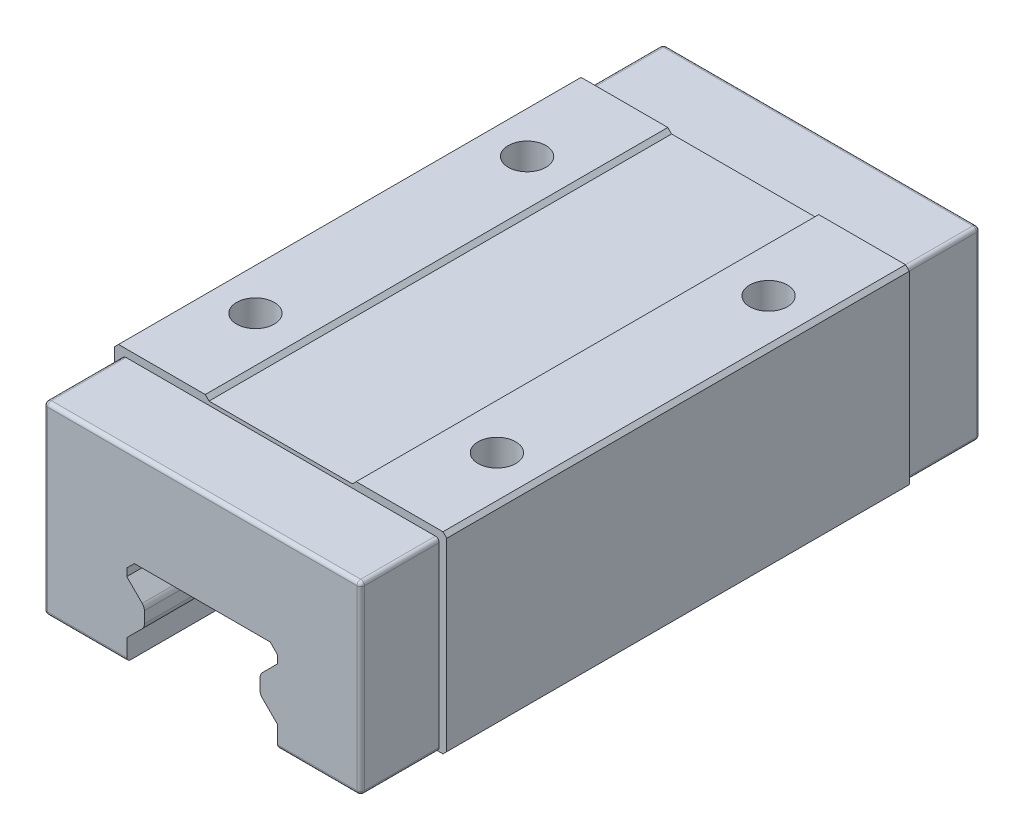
ISO-10303-21;
HEADER;
FILE_DESCRIPTION(('STEP AP214'),'2;1');
FILE_NAME('part.step','',(''),(''),'','','');
FILE_SCHEMA(('AUTOMOTIVE_DESIGN { 1 0 10303 214 1 1 1 1 }'));
ENDSEC;
DATA;
#1=APPLICATION_CONTEXT('core data for automotive mechanical design processes');
#2=APPLICATION_PROTOCOL_DEFINITION('international standard','automotive_design',2000,#1);
#3=PRODUCT_CONTEXT('',#1,'mechanical');
#4=PRODUCT('Part','Part','',(#3));
#5=PRODUCT_RELATED_PRODUCT_CATEGORY('part','',(#4));
#6=PRODUCT_DEFINITION_FORMATION('','',#4);
#7=PRODUCT_DEFINITION_CONTEXT('part definition',#1,'design');
#8=PRODUCT_DEFINITION('design','',#6,#7);
#9=PRODUCT_DEFINITION_SHAPE('','',#8);
#10=(LENGTH_UNIT() NAMED_UNIT(*) SI_UNIT(.MILLI.,.METRE.));
#11=(NAMED_UNIT(*) PLANE_ANGLE_UNIT() SI_UNIT($,.RADIAN.));
#12=(NAMED_UNIT(*) SI_UNIT($,.STERADIAN.) SOLID_ANGLE_UNIT());
#13=UNCERTAINTY_MEASURE_WITH_UNIT(LENGTH_MEASURE(1.E-05),#10,'distance_accuracy_value','');
#14=(GEOMETRIC_REPRESENTATION_CONTEXT(3) GLOBAL_UNCERTAINTY_ASSIGNED_CONTEXT((#13)) GLOBAL_UNIT_ASSIGNED_CONTEXT((#10,
#11,#12)) REPRESENTATION_CONTEXT('',''));
#15=CARTESIAN_POINT('',(0.,0.,0.));
#16=DIRECTION('',(0.,0.,1.));
#17=DIRECTION('',(1.,0.,0.));
#18=AXIS2_PLACEMENT_3D('',#15,#16,#17);
#19=CARTESIAN_POINT('',(-22.,30.,30.65));
#20=DIRECTION('',(0.,-1.,0.));
#21=DIRECTION('',(0.,0.,-1.));
#22=AXIS2_PLACEMENT_3D('',#19,#20,#21);
#23=PLANE('',#22);
#24=CARTESIAN_POINT('',(-16.,30.,18.));
#25=DIRECTION('',(0.,1.,0.));
#26=DIRECTION('',(-1.,0.,0.));
#27=AXIS2_PLACEMENT_3D('',#24,#25,#26);
#28=CIRCLE('',#27,2.5);
#29=CARTESIAN_POINT('',(-18.5,30.,18.));
#30=VERTEX_POINT('',#29);
#31=EDGE_CURVE('E1098',#30,#30,#28,.T.);
#32=ORIENTED_EDGE('',*,*,#31,.F.);
#33=EDGE_LOOP('',(#32));
#34=FACE_BOUND('',#33,.T.);
#35=CARTESIAN_POINT('',(-16.,30.,-18.));
#36=DIRECTION('',(0.,1.,0.));
#37=DIRECTION('',(-1.,0.,0.));
#38=AXIS2_PLACEMENT_3D('',#35,#36,#37);
#39=CIRCLE('',#38,2.5);
#40=CARTESIAN_POINT('',(-18.5,30.,-18.));
#41=VERTEX_POINT('',#40);
#42=EDGE_CURVE('E1075',#41,#41,#39,.T.);
#43=ORIENTED_EDGE('',*,*,#42,.F.);
#44=EDGE_LOOP('',(#43));
#45=FACE_BOUND('',#44,.T.);
#46=DIRECTION('',(-1.,0.,0.));
#47=VECTOR('',#46,1.);
#48=CARTESIAN_POINT('',(-22.,30.,-30.65));
#49=LINE('',#48,#47);
#50=CARTESIAN_POINT('',(-10.,30.,-30.65));
#51=VERTEX_POINT('',#50);
#52=CARTESIAN_POINT('',(-21.5,30.,-30.65));
#53=VERTEX_POINT('',#52);
#54=EDGE_CURVE('E787',#51,#53,#49,.T.);
#55=ORIENTED_EDGE('',*,*,#54,.T.);
#56=DIRECTION('',(0.,0.,1.));
#57=VECTOR('',#56,1.);
#58=CARTESIAN_POINT('',(-21.5,30.,30.65));
#59=LINE('',#58,#57);
#60=CARTESIAN_POINT('',(-21.5,30.,30.65));
#61=VERTEX_POINT('',#60);
#62=EDGE_CURVE('E391',#53,#61,#59,.T.);
#63=ORIENTED_EDGE('',*,*,#62,.T.);
#64=DIRECTION('',(-1.,0.,0.));
#65=VECTOR('',#64,1.);
#66=CARTESIAN_POINT('',(-22.,30.,30.65));
#67=LINE('',#66,#65);
#68=CARTESIAN_POINT('',(-10.,30.,30.65));
#69=VERTEX_POINT('',#68);
#70=EDGE_CURVE('E374',#69,#61,#67,.T.);
#71=ORIENTED_EDGE('',*,*,#70,.F.);
#72=DIRECTION('',(0.,0.,-1.));
#73=VECTOR('',#72,1.);
#74=CARTESIAN_POINT('',(-10.,30.,30.65));
#75=LINE('',#74,#73);
#76=EDGE_CURVE('E388',#69,#51,#75,.T.);
#77=ORIENTED_EDGE('',*,*,#76,.T.);
#78=EDGE_LOOP('',(#55,#63,#71,#77));
#79=FACE_BOUND('',#78,.T.);
#80=ADVANCED_FACE('F39',(#34,#45,#79),#23,.F.);
#81=CARTESIAN_POINT('',(9.99999999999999,16.3,-41.05));
#82=DIRECTION('',(1.,0.,0.));
#83=DIRECTION('',(0.,1.,0.));
#84=AXIS2_PLACEMENT_3D('',#81,#82,#83);
#85=PLANE('',#84);
#86=DIRECTION('',(0.,-1.,0.));
#87=VECTOR('',#86,1.);
#88=CARTESIAN_POINT('',(10.,0.,41.05));
#89=LINE('',#88,#87);
#90=CARTESIAN_POINT('',(9.99999999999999,15.3,41.05));
#91=VERTEX_POINT('',#90);
#92=CARTESIAN_POINT('',(10.,14.3,41.05));
#93=VERTEX_POINT('',#92);
#94=EDGE_CURVE('E810',#91,#93,#89,.T.);
#95=ORIENTED_EDGE('',*,*,#94,.F.);
#96=DIRECTION('',(0.,0.,-1.));
#97=VECTOR('',#96,1.);
#98=CARTESIAN_POINT('',(9.99999999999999,15.3,-41.05));
#99=LINE('',#98,#97);
#100=CARTESIAN_POINT('',(9.99999999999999,15.3,-41.05));
#101=VERTEX_POINT('',#100);
#102=EDGE_CURVE('E820',#91,#101,#99,.T.);
#103=ORIENTED_EDGE('',*,*,#102,.T.);
#104=DIRECTION('',(0.,1.,0.));
#105=VECTOR('',#104,1.);
#106=CARTESIAN_POINT('',(9.99999999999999,16.3,-41.05));
#107=LINE('',#106,#105);
#108=CARTESIAN_POINT('',(10.,14.3,-41.05));
#109=VERTEX_POINT('',#108);
#110=EDGE_CURVE('E946',#109,#101,#107,.T.);
#111=ORIENTED_EDGE('',*,*,#110,.F.);
#112=DIRECTION('',(0.,0.,1.));
#113=VECTOR('',#112,1.);
#114=CARTESIAN_POINT('',(10.,14.3,-48.4286478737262));
#115=LINE('',#114,#113);
#116=EDGE_CURVE('E1056',#109,#93,#115,.T.);
#117=ORIENTED_EDGE('',*,*,#116,.T.);
#118=EDGE_LOOP('',(#95,#103,#111,#117));
#119=FACE_BOUND('',#118,.T.);
#120=ADVANCED_FACE('F1117',(#119),#85,.F.);
#121=CARTESIAN_POINT('',(-10.,16.3,-41.05));
#122=DIRECTION('',(-1.,0.,0.));
#123=DIRECTION('',(0.,-1.,0.));
#124=AXIS2_PLACEMENT_3D('',#121,#122,#123);
#125=PLANE('',#124);
#126=DIRECTION('',(0.,-1.,0.));
#127=VECTOR('',#126,1.);
#128=CARTESIAN_POINT('',(-10.,16.3,41.05));
#129=LINE('',#128,#127);
#130=CARTESIAN_POINT('',(-10.,7.3,41.05));
#131=VERTEX_POINT('',#130);
#132=CARTESIAN_POINT('',(-10.,5.,41.05));
#133=VERTEX_POINT('',#132);
#134=EDGE_CURVE('E955',#131,#133,#129,.T.);
#135=ORIENTED_EDGE('',*,*,#134,.T.);
#136=CARTESIAN_POINT('',(-10.,5.,40.55));
#137=DIRECTION('',(-1.,0.,0.));
#138=DIRECTION('',(0.,-1.,0.));
#139=AXIS2_PLACEMENT_3D('',#136,#137,#138);
#140=CIRCLE('',#139,0.5);
#141=CARTESIAN_POINT('',(-10.,4.5,40.55));
#142=VERTEX_POINT('',#141);
#143=EDGE_CURVE('E561',#133,#142,#140,.F.);
#144=ORIENTED_EDGE('',*,*,#143,.T.);
#145=DIRECTION('',(0.,0.,1.));
#146=VECTOR('',#145,1.);
#147=CARTESIAN_POINT('',(-10.,4.5,30.65));
#148=LINE('',#147,#146);
#149=CARTESIAN_POINT('',(-10.,4.5,-40.55));
#150=VERTEX_POINT('',#149);
#151=EDGE_CURVE('E751',#150,#142,#148,.T.);
#152=ORIENTED_EDGE('',*,*,#151,.F.);
#153=CARTESIAN_POINT('',(-10.,5.,-40.55));
#154=DIRECTION('',(-1.,0.,0.));
#155=DIRECTION('',(0.,-1.,0.));
#156=AXIS2_PLACEMENT_3D('',#153,#154,#155);
#157=CIRCLE('',#156,0.5);
#158=CARTESIAN_POINT('',(-10.,5.,-41.05));
#159=VERTEX_POINT('',#158);
#160=EDGE_CURVE('E558',#150,#159,#157,.F.);
#161=ORIENTED_EDGE('',*,*,#160,.T.);
#162=DIRECTION('',(0.,-1.,0.));
#163=VECTOR('',#162,1.);
#164=CARTESIAN_POINT('',(-10.,16.3,-41.05));
#165=LINE('',#164,#163);
#166=CARTESIAN_POINT('',(-10.,7.3,-41.05));
#167=VERTEX_POINT('',#166);
#168=EDGE_CURVE('E950',#167,#159,#165,.T.);
#169=ORIENTED_EDGE('',*,*,#168,.F.);
#170=DIRECTION('',(0.,0.,1.));
#171=VECTOR('',#170,1.);
#172=CARTESIAN_POINT('',(-10.,7.3,-48.4286478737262));
#173=LINE('',#172,#171);
#174=EDGE_CURVE('E918',#167,#131,#173,.T.);
#175=ORIENTED_EDGE('',*,*,#174,.T.);
#176=EDGE_LOOP('',(#135,#144,#152,#161,#169,#175));
#177=FACE_BOUND('',#176,.T.);
#178=ADVANCED_FACE('F967',(#177),#125,.F.);
#179=CARTESIAN_POINT('',(-22.,4.5,30.65));
#180=DIRECTION('',(0.,1.,0.));
#181=DIRECTION('',(-1.,0.,0.));
#182=AXIS2_PLACEMENT_3D('',#179,#180,#181);
#183=PLANE('',#182);
#184=DIRECTION('',(0.,0.,-1.));
#185=VECTOR('',#184,1.);
#186=CARTESIAN_POINT('',(20.5,4.5,30.65));
#187=LINE('',#186,#185);
#188=CARTESIAN_POINT('',(20.5,4.5,30.65));
#189=VERTEX_POINT('',#188);
#190=CARTESIAN_POINT('',(20.5,4.5,40.55));
#191=VERTEX_POINT('',#190);
#192=EDGE_CURVE('E507',#189,#191,#187,.F.);
#193=ORIENTED_EDGE('',*,*,#192,.T.);
#194=DIRECTION('',(1.,0.,0.));
#195=VECTOR('',#194,1.);
#196=CARTESIAN_POINT('',(-22.,4.5,40.55));
#197=LINE('',#196,#195);
#198=CARTESIAN_POINT('',(10.,4.5,40.55));
#199=VERTEX_POINT('',#198);
#200=EDGE_CURVE('E510',#191,#199,#197,.F.);
#201=ORIENTED_EDGE('',*,*,#200,.T.);
#202=DIRECTION('',(0.,0.,-1.));
#203=VECTOR('',#202,1.);
#204=CARTESIAN_POINT('',(10.,4.5,30.65));
#205=LINE('',#204,#203);
#206=CARTESIAN_POINT('',(10.,4.5,-40.55));
#207=VERTEX_POINT('',#206);
#208=EDGE_CURVE('E743',#199,#207,#205,.T.);
#209=ORIENTED_EDGE('',*,*,#208,.T.);
#210=DIRECTION('',(1.,0.,0.));
#211=VECTOR('',#210,1.);
#212=CARTESIAN_POINT('',(21.,4.5,-40.55));
#213=LINE('',#212,#211);
#214=CARTESIAN_POINT('',(20.5,4.5,-40.55));
#215=VERTEX_POINT('',#214);
#216=EDGE_CURVE('E504',#207,#215,#213,.T.);
#217=ORIENTED_EDGE('',*,*,#216,.T.);
#218=DIRECTION('',(0.,0.,-1.));
#219=VECTOR('',#218,1.);
#220=CARTESIAN_POINT('',(20.5,4.5,30.65));
#221=LINE('',#220,#219);
#222=CARTESIAN_POINT('',(20.5,4.5,-30.65));
#223=VERTEX_POINT('',#222);
#224=EDGE_CURVE('E500',#215,#223,#221,.F.);
#225=ORIENTED_EDGE('',*,*,#224,.T.);
#226=DIRECTION('',(1.,0.,0.));
#227=VECTOR('',#226,1.);
#228=CARTESIAN_POINT('',(-22.,4.5,-30.65));
#229=LINE('',#228,#227);
#230=CARTESIAN_POINT('',(21.5,4.5,-30.65));
#231=VERTEX_POINT('',#230);
#232=EDGE_CURVE('E796',#223,#231,#229,.T.);
#233=ORIENTED_EDGE('',*,*,#232,.T.);
#234=DIRECTION('',(0.,0.,1.));
#235=VECTOR('',#234,1.);
#236=CARTESIAN_POINT('',(21.5,4.5,30.65));
#237=LINE('',#236,#235);
#238=CARTESIAN_POINT('',(21.5,4.5,30.65));
#239=VERTEX_POINT('',#238);
#240=EDGE_CURVE('E448',#231,#239,#237,.T.);
#241=ORIENTED_EDGE('',*,*,#240,.T.);
#242=DIRECTION('',(1.,0.,0.));
#243=VECTOR('',#242,1.);
#244=CARTESIAN_POINT('',(-22.,4.5,30.65));
#245=LINE('',#244,#243);
#246=EDGE_CURVE('E779',#189,#239,#245,.T.);
#247=ORIENTED_EDGE('',*,*,#246,.F.);
#248=EDGE_LOOP('',(#193,#201,#209,#217,#225,#233,#241,#247));
#249=FACE_BOUND('',#248,.T.);
#250=ADVANCED_FACE('F742',(#249),#183,.F.);
#251=CARTESIAN_POINT('',(0.,0.,30.65));
#252=DIRECTION('',(0.,0.,-1.));
#253=DIRECTION('',(-1.,0.,0.));
#254=AXIS2_PLACEMENT_3D('',#251,#252,#253);
#255=PLANE('',#254);
#256=DIRECTION('',(0.,1.,0.));
#257=VECTOR('',#256,1.);
#258=CARTESIAN_POINT('',(22.,4.5,30.65));
#259=LINE('',#258,#257);
#260=CARTESIAN_POINT('',(22.,5.00000000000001,30.65));
#261=VERTEX_POINT('',#260);
#262=CARTESIAN_POINT('',(22.,29.5,30.65));
#263=VERTEX_POINT('',#262);
#264=EDGE_CURVE('E394',#261,#263,#259,.T.);
#265=ORIENTED_EDGE('',*,*,#264,.T.);
#266=DIRECTION('',(0.707106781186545,-0.70710678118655,0.));
#267=VECTOR('',#266,1.);
#268=CARTESIAN_POINT('',(21.5,30.,30.65));
#269=LINE('',#268,#267);
#270=CARTESIAN_POINT('',(21.5,30.,30.65));
#271=VERTEX_POINT('',#270);
#272=EDGE_CURVE('E445',#263,#271,#269,.F.);
#273=ORIENTED_EDGE('',*,*,#272,.T.);
#274=CARTESIAN_POINT('',(10.,30.,30.65));
#275=VERTEX_POINT('',#274);
#276=EDGE_CURVE('E393',#271,#275,#67,.T.);
#277=ORIENTED_EDGE('',*,*,#276,.T.);
#278=DIRECTION('',(0.707106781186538,0.707106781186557,0.));
#279=VECTOR('',#278,1.);
#280=CARTESIAN_POINT('',(-9.99999999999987,9.99999999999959,30.65));
#281=LINE('',#280,#279);
#282=CARTESIAN_POINT('',(9.5,29.5,30.65));
#283=VERTEX_POINT('',#282);
#284=EDGE_CURVE('E470',#275,#283,#281,.F.);
#285=ORIENTED_EDGE('',*,*,#284,.T.);
#286=DIRECTION('',(1.,0.,0.));
#287=VECTOR('',#286,1.);
#288=CARTESIAN_POINT('',(-10.,29.5,30.65));
#289=LINE('',#288,#287);
#290=CARTESIAN_POINT('',(-9.5,29.5,30.65));
#291=VERTEX_POINT('',#290);
#292=EDGE_CURVE('E377',#291,#283,#289,.T.);
#293=ORIENTED_EDGE('',*,*,#292,.F.);
#294=DIRECTION('',(0.707106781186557,-0.707106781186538,0.));
#295=VECTOR('',#294,1.);
#296=CARTESIAN_POINT('',(10.0000000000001,10.0000000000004,30.65));
#297=LINE('',#296,#295);
#298=EDGE_CURVE('E370',#291,#69,#297,.F.);
#299=ORIENTED_EDGE('',*,*,#298,.T.);
#300=ORIENTED_EDGE('',*,*,#70,.T.);
#301=DIRECTION('',(0.707106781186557,0.707106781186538,0.));
#302=VECTOR('',#301,1.);
#303=CARTESIAN_POINT('',(-22.,29.5,30.65));
#304=LINE('',#303,#302);
#305=CARTESIAN_POINT('',(-22.,29.5,30.65));
#306=VERTEX_POINT('',#305);
#307=EDGE_CURVE('E436',#61,#306,#304,.F.);
#308=ORIENTED_EDGE('',*,*,#307,.T.);
#309=DIRECTION('',(0.,-1.,0.));
#310=VECTOR('',#309,1.);
#311=CARTESIAN_POINT('',(-22.,4.5,30.65));
#312=LINE('',#311,#310);
#313=CARTESIAN_POINT('',(-22.,5.,30.65));
#314=VERTEX_POINT('',#313);
#315=EDGE_CURVE('E775',#306,#314,#312,.T.);
#316=ORIENTED_EDGE('',*,*,#315,.T.);
#317=DIRECTION('',(-0.707106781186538,0.707106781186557,0.));
#318=VECTOR('',#317,1.);
#319=CARTESIAN_POINT('',(-21.5,4.5,30.65));
#320=LINE('',#319,#318);
#321=CARTESIAN_POINT('',(-21.5,4.5,30.65));
#322=VERTEX_POINT('',#321);
#323=EDGE_CURVE('E439',#314,#322,#320,.F.);
#324=ORIENTED_EDGE('',*,*,#323,.T.);
#325=CARTESIAN_POINT('',(-20.5,4.5,30.65));
#326=VERTEX_POINT('',#325);
#327=EDGE_CURVE('E780',#322,#326,#245,.T.);
#328=ORIENTED_EDGE('',*,*,#327,.T.);
#329=CARTESIAN_POINT('',(-20.5,5.,30.65));
#330=DIRECTION('',(0.,0.,-1.));
#331=DIRECTION('',(-1.,0.,0.));
#332=AXIS2_PLACEMENT_3D('',#329,#330,#331);
#333=CIRCLE('',#332,0.5);
#334=CARTESIAN_POINT('',(-21.,5.,30.65));
#335=VERTEX_POINT('',#334);
#336=EDGE_CURVE('E602',#326,#335,#333,.T.);
#337=ORIENTED_EDGE('',*,*,#336,.T.);
#338=DIRECTION('',(0.,-1.,0.));
#339=VECTOR('',#338,1.);
#340=CARTESIAN_POINT('',(-21.,0.,30.65));
#341=LINE('',#340,#339);
#342=CARTESIAN_POINT('',(-21.,28.5,30.65));
#343=VERTEX_POINT('',#342);
#344=EDGE_CURVE('E766',#343,#335,#341,.T.);
#345=ORIENTED_EDGE('',*,*,#344,.F.);
#346=CARTESIAN_POINT('',(-20.5,28.5,30.65));
#347=DIRECTION('',(0.,0.,-1.));
#348=DIRECTION('',(-1.,0.,0.));
#349=AXIS2_PLACEMENT_3D('',#346,#347,#348);
#350=CIRCLE('',#349,0.5);
#351=CARTESIAN_POINT('',(-20.5,29.,30.65));
#352=VERTEX_POINT('',#351);
#353=EDGE_CURVE('E609',#343,#352,#350,.T.);
#354=ORIENTED_EDGE('',*,*,#353,.T.);
#355=DIRECTION('',(-1.,0.,0.));
#356=VECTOR('',#355,1.);
#357=CARTESIAN_POINT('',(0.,29.,30.65));
#358=LINE('',#357,#356);
#359=CARTESIAN_POINT('',(20.5,29.,30.65));
#360=VERTEX_POINT('',#359);
#361=EDGE_CURVE('E750',#360,#352,#358,.T.);
#362=ORIENTED_EDGE('',*,*,#361,.F.);
#363=CARTESIAN_POINT('',(20.5,28.5,30.65));
#364=DIRECTION('',(0.,0.,-1.));
#365=DIRECTION('',(-1.,0.,0.));
#366=AXIS2_PLACEMENT_3D('',#363,#364,#365);
#367=CIRCLE('',#366,0.5);
#368=CARTESIAN_POINT('',(21.,28.5,30.65));
#369=VERTEX_POINT('',#368);
#370=EDGE_CURVE('E612',#360,#369,#367,.T.);
#371=ORIENTED_EDGE('',*,*,#370,.T.);
#372=DIRECTION('',(0.,1.,0.));
#373=VECTOR('',#372,1.);
#374=CARTESIAN_POINT('',(21.,0.,30.65));
#375=LINE('',#374,#373);
#376=CARTESIAN_POINT('',(21.,5.,30.65));
#377=VERTEX_POINT('',#376);
#378=EDGE_CURVE('E755',#377,#369,#375,.T.);
#379=ORIENTED_EDGE('',*,*,#378,.F.);
#380=CARTESIAN_POINT('',(20.5,5.,30.65));
#381=DIRECTION('',(0.,0.,-1.));
#382=DIRECTION('',(-1.,0.,0.));
#383=AXIS2_PLACEMENT_3D('',#380,#381,#382);
#384=CIRCLE('',#383,0.5);
#385=EDGE_CURVE('E605',#377,#189,#384,.T.);
#386=ORIENTED_EDGE('',*,*,#385,.T.);
#387=ORIENTED_EDGE('',*,*,#246,.T.);
#388=DIRECTION('',(-0.707106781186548,-0.707106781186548,0.));
#389=VECTOR('',#388,1.);
#390=CARTESIAN_POINT('',(22.,5.00000000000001,30.65));
#391=LINE('',#390,#389);
#392=EDGE_CURVE('E442',#239,#261,#391,.F.);
#393=ORIENTED_EDGE('',*,*,#392,.T.);
#394=EDGE_LOOP('',(#265,#273,#277,#285,#293,#299,#300,#308,#316,#324,#328,#337,#345,#354,#362,
#371,#379,#386,#387,#393));
#395=FACE_BOUND('',#394,.T.);
#396=ADVANCED_FACE('F373',(#395),#255,.F.);
#397=CARTESIAN_POINT('',(0.,0.,-30.65));
#398=DIRECTION('',(0.,0.,-1.));
#399=DIRECTION('',(-1.,0.,0.));
#400=AXIS2_PLACEMENT_3D('',#397,#398,#399);
#401=PLANE('',#400);
#402=CARTESIAN_POINT('',(21.5,30.,-30.65));
#403=VERTEX_POINT('',#402);
#404=CARTESIAN_POINT('',(10.,30.,-30.65));
#405=VERTEX_POINT('',#404);
#406=EDGE_CURVE('E788',#403,#405,#49,.T.);
#407=ORIENTED_EDGE('',*,*,#406,.F.);
#408=DIRECTION('',(-0.707106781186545,0.70710678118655,0.));
#409=VECTOR('',#408,1.);
#410=CARTESIAN_POINT('',(25.7500000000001,25.7499999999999,-30.65));
#411=LINE('',#410,#409);
#412=CARTESIAN_POINT('',(22.,29.5,-30.65));
#413=VERTEX_POINT('',#412);
#414=EDGE_CURVE('E426',#403,#413,#411,.F.);
#415=ORIENTED_EDGE('',*,*,#414,.T.);
#416=DIRECTION('',(0.,1.,0.));
#417=VECTOR('',#416,1.);
#418=CARTESIAN_POINT('',(22.,4.5,-30.65));
#419=LINE('',#418,#417);
#420=CARTESIAN_POINT('',(22.,5.00000000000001,-30.65));
#421=VERTEX_POINT('',#420);
#422=EDGE_CURVE('E770',#421,#413,#419,.T.);
#423=ORIENTED_EDGE('',*,*,#422,.F.);
#424=DIRECTION('',(0.707106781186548,0.707106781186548,0.));
#425=VECTOR('',#424,1.);
#426=CARTESIAN_POINT('',(8.49999999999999,-8.49999999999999,-30.65));
#427=LINE('',#426,#425);
#428=EDGE_CURVE('E423',#421,#231,#427,.F.);
#429=ORIENTED_EDGE('',*,*,#428,.T.);
#430=ORIENTED_EDGE('',*,*,#232,.F.);
#431=CARTESIAN_POINT('',(20.5,5.,-30.65));
#432=DIRECTION('',(0.,0.,-1.));
#433=DIRECTION('',(-1.,0.,0.));
#434=AXIS2_PLACEMENT_3D('',#431,#432,#433);
#435=CIRCLE('',#434,0.5);
#436=CARTESIAN_POINT('',(21.,5.,-30.65));
#437=VERTEX_POINT('',#436);
#438=EDGE_CURVE('E615',#223,#437,#435,.F.);
#439=ORIENTED_EDGE('',*,*,#438,.T.);
#440=DIRECTION('',(0.,1.,0.));
#441=VECTOR('',#440,1.);
#442=CARTESIAN_POINT('',(21.,0.,-30.65));
#443=LINE('',#442,#441);
#444=CARTESIAN_POINT('',(21.,28.5,-30.65));
#445=VERTEX_POINT('',#444);
#446=EDGE_CURVE('E802',#437,#445,#443,.T.);
#447=ORIENTED_EDGE('',*,*,#446,.T.);
#448=CARTESIAN_POINT('',(20.5,28.5,-30.65));
#449=DIRECTION('',(0.,0.,-1.));
#450=DIRECTION('',(-1.,0.,0.));
#451=AXIS2_PLACEMENT_3D('',#448,#449,#450);
#452=CIRCLE('',#451,0.5);
#453=CARTESIAN_POINT('',(20.5,29.,-30.65));
#454=VERTEX_POINT('',#453);
#455=EDGE_CURVE('E49',#445,#454,#452,.F.);
#456=ORIENTED_EDGE('',*,*,#455,.T.);
#457=DIRECTION('',(-1.,0.,0.));
#458=VECTOR('',#457,1.);
#459=CARTESIAN_POINT('',(0.,29.,-30.65));
#460=LINE('',#459,#458);
#461=CARTESIAN_POINT('',(-20.5,29.,-30.65));
#462=VERTEX_POINT('',#461);
#463=EDGE_CURVE('E783',#454,#462,#460,.T.);
#464=ORIENTED_EDGE('',*,*,#463,.T.);
#465=CARTESIAN_POINT('',(-20.5,28.5,-30.65));
#466=DIRECTION('',(0.,0.,-1.));
#467=DIRECTION('',(-1.,0.,0.));
#468=AXIS2_PLACEMENT_3D('',#465,#466,#467);
#469=CIRCLE('',#468,0.5);
#470=CARTESIAN_POINT('',(-21.,28.5,-30.65));
#471=VERTEX_POINT('',#470);
#472=EDGE_CURVE('E11',#462,#471,#469,.F.);
#473=ORIENTED_EDGE('',*,*,#472,.T.);
#474=DIRECTION('',(0.,-1.,0.));
#475=VECTOR('',#474,1.);
#476=CARTESIAN_POINT('',(-21.,0.,-30.65));
#477=LINE('',#476,#475);
#478=CARTESIAN_POINT('',(-21.,5.,-30.65));
#479=VERTEX_POINT('',#478);
#480=EDGE_CURVE('E806',#471,#479,#477,.T.);
#481=ORIENTED_EDGE('',*,*,#480,.T.);
#482=CARTESIAN_POINT('',(-20.5,5.,-30.65));
#483=DIRECTION('',(0.,0.,-1.));
#484=DIRECTION('',(-1.,0.,0.));
#485=AXIS2_PLACEMENT_3D('',#482,#483,#484);
#486=CIRCLE('',#485,0.5);
#487=CARTESIAN_POINT('',(-20.5,4.5,-30.65));
#488=VERTEX_POINT('',#487);
#489=EDGE_CURVE('E598',#479,#488,#486,.F.);
#490=ORIENTED_EDGE('',*,*,#489,.T.);
#491=CARTESIAN_POINT('',(-21.5,4.5,-30.65));
#492=VERTEX_POINT('',#491);
#493=EDGE_CURVE('E772',#492,#488,#229,.T.);
#494=ORIENTED_EDGE('',*,*,#493,.F.);
#495=DIRECTION('',(0.707106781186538,-0.707106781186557,0.));
#496=VECTOR('',#495,1.);
#497=CARTESIAN_POINT('',(-8.5000000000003,-8.50000000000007,-30.65));
#498=LINE('',#497,#496);
#499=CARTESIAN_POINT('',(-22.,5.,-30.65));
#500=VERTEX_POINT('',#499);
#501=EDGE_CURVE('E420',#492,#500,#498,.F.);
#502=ORIENTED_EDGE('',*,*,#501,.T.);
#503=DIRECTION('',(0.,-1.,0.));
#504=VECTOR('',#503,1.);
#505=CARTESIAN_POINT('',(-22.,4.5,-30.65));
#506=LINE('',#505,#504);
#507=CARTESIAN_POINT('',(-22.,29.5,-30.65));
#508=VERTEX_POINT('',#507);
#509=EDGE_CURVE('E792',#508,#500,#506,.T.);
#510=ORIENTED_EDGE('',*,*,#509,.F.);
#511=DIRECTION('',(-0.707106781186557,-0.707106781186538,0.));
#512=VECTOR('',#511,1.);
#513=CARTESIAN_POINT('',(-25.7499999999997,25.7500000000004,-30.65));
#514=LINE('',#513,#512);
#515=EDGE_CURVE('E417',#508,#53,#514,.F.);
#516=ORIENTED_EDGE('',*,*,#515,.T.);
#517=ORIENTED_EDGE('',*,*,#54,.F.);
#518=DIRECTION('',(-0.707106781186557,0.707106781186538,0.));
#519=VECTOR('',#518,1.);
#520=CARTESIAN_POINT('',(-9.5,29.5,-30.65));
#521=LINE('',#520,#519);
#522=CARTESIAN_POINT('',(-9.5,29.5,-30.65));
#523=VERTEX_POINT('',#522);
#524=EDGE_CURVE('E383',#51,#523,#521,.F.);
#525=ORIENTED_EDGE('',*,*,#524,.T.);
#526=DIRECTION('',(-1.,0.,0.));
#527=VECTOR('',#526,1.);
#528=CARTESIAN_POINT('',(0.,29.5,-30.65));
#529=LINE('',#528,#527);
#530=CARTESIAN_POINT('',(9.5,29.5,-30.65));
#531=VERTEX_POINT('',#530);
#532=EDGE_CURVE('E399',#531,#523,#529,.T.);
#533=ORIENTED_EDGE('',*,*,#532,.F.);
#534=DIRECTION('',(-0.707106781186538,-0.707106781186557,0.));
#535=VECTOR('',#534,1.);
#536=CARTESIAN_POINT('',(10.,30.,-30.65));
#537=LINE('',#536,#535);
#538=EDGE_CURVE('E384',#531,#405,#537,.F.);
#539=ORIENTED_EDGE('',*,*,#538,.T.);
#540=EDGE_LOOP('',(#407,#415,#423,#429,#430,#439,#447,#456,#464,#473,#481,#490,#494,#502,#510,
#516,#517,#525,#533,#539));
#541=FACE_BOUND('',#540,.T.);
#542=ADVANCED_FACE('F1023',(#541),#401,.T.);
#543=CARTESIAN_POINT('',(22.,4.5,30.65));
#544=DIRECTION('',(-1.,0.,0.));
#545=DIRECTION('',(0.,-1.,0.));
#546=AXIS2_PLACEMENT_3D('',#543,#544,#545);
#547=PLANE('',#546);
#548=ORIENTED_EDGE('',*,*,#422,.T.);
#549=DIRECTION('',(0.,0.,1.));
#550=VECTOR('',#549,1.);
#551=CARTESIAN_POINT('',(22.,29.5,30.65));
#552=LINE('',#551,#550);
#553=EDGE_CURVE('E433',#413,#263,#552,.T.);
#554=ORIENTED_EDGE('',*,*,#553,.T.);
#555=ORIENTED_EDGE('',*,*,#264,.F.);
#556=DIRECTION('',(0.,0.,-1.));
#557=VECTOR('',#556,1.);
#558=CARTESIAN_POINT('',(22.,5.00000000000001,30.65));
#559=LINE('',#558,#557);
#560=EDGE_CURVE('E429',#261,#421,#559,.T.);
#561=ORIENTED_EDGE('',*,*,#560,.T.);
#562=EDGE_LOOP('',(#548,#554,#555,#561));
#563=FACE_BOUND('',#562,.T.);
#564=ADVANCED_FACE('F1193',(#563),#547,.F.);
#565=CARTESIAN_POINT('',(16.,30.,-18.));
#566=DIRECTION('',(0.,1.,0.));
#567=DIRECTION('',(-1.,0.,0.));
#568=AXIS2_PLACEMENT_3D('',#565,#566,#567);
#569=CIRCLE('',#568,2.5);
#570=CARTESIAN_POINT('',(13.5,30.,-18.));
#571=VERTEX_POINT('',#570);
#572=EDGE_CURVE('E1082',#571,#571,#569,.T.);
#573=ORIENTED_EDGE('',*,*,#572,.F.);
#574=EDGE_LOOP('',(#573));
#575=FACE_BOUND('',#574,.T.);
#576=CARTESIAN_POINT('',(16.,30.,18.));
#577=DIRECTION('',(0.,1.,0.));
#578=DIRECTION('',(-1.,0.,0.));
#579=AXIS2_PLACEMENT_3D('',#576,#577,#578);
#580=CIRCLE('',#579,2.5);
#581=CARTESIAN_POINT('',(13.5,30.,18.));
#582=VERTEX_POINT('',#581);
#583=EDGE_CURVE('E1090',#582,#582,#580,.T.);
#584=ORIENTED_EDGE('',*,*,#583,.F.);
#585=EDGE_LOOP('',(#584));
#586=FACE_BOUND('',#585,.T.);
#587=ORIENTED_EDGE('',*,*,#276,.F.);
#588=DIRECTION('',(0.,0.,-1.));
#589=VECTOR('',#588,1.);
#590=CARTESIAN_POINT('',(21.5,30.,30.65));
#591=LINE('',#590,#589);
#592=EDGE_CURVE('E406',#271,#403,#591,.T.);
#593=ORIENTED_EDGE('',*,*,#592,.T.);
#594=ORIENTED_EDGE('',*,*,#406,.T.);
#595=DIRECTION('',(0.,0.,1.));
#596=VECTOR('',#595,1.);
#597=CARTESIAN_POINT('',(10.,30.,30.65));
#598=LINE('',#597,#596);
#599=EDGE_CURVE('E400',#405,#275,#598,.T.);
#600=ORIENTED_EDGE('',*,*,#599,.T.);
#601=EDGE_LOOP('',(#587,#593,#594,#600));
#602=FACE_BOUND('',#601,.T.);
#603=ADVANCED_FACE('F1119',(#575,#586,#602),#23,.F.);
#604=CARTESIAN_POINT('',(-22.,4.5,30.65));
#605=DIRECTION('',(1.,0.,0.));
#606=DIRECTION('',(0.,0.,-1.));
#607=AXIS2_PLACEMENT_3D('',#604,#605,#606);
#608=PLANE('',#607);
#609=ORIENTED_EDGE('',*,*,#509,.T.);
#610=DIRECTION('',(0.,0.,1.));
#611=VECTOR('',#610,1.);
#612=CARTESIAN_POINT('',(-22.,5.,30.65));
#613=LINE('',#612,#611);
#614=EDGE_CURVE('E459',#500,#314,#613,.T.);
#615=ORIENTED_EDGE('',*,*,#614,.T.);
#616=ORIENTED_EDGE('',*,*,#315,.F.);
#617=DIRECTION('',(0.,0.,-1.));
#618=VECTOR('',#617,1.);
#619=CARTESIAN_POINT('',(-22.,29.5,30.65));
#620=LINE('',#619,#618);
#621=EDGE_CURVE('E455',#306,#508,#620,.T.);
#622=ORIENTED_EDGE('',*,*,#621,.T.);
#623=EDGE_LOOP('',(#609,#615,#616,#622));
#624=FACE_BOUND('',#623,.T.);
#625=ADVANCED_FACE('F1196',(#624),#608,.F.);
#626=DIRECTION('',(0.,0.,-1.));
#627=VECTOR('',#626,1.);
#628=CARTESIAN_POINT('',(-20.5,4.5,30.65));
#629=LINE('',#628,#627);
#630=CARTESIAN_POINT('',(-20.5,4.5,40.55));
#631=VERTEX_POINT('',#630);
#632=EDGE_CURVE('E487',#631,#326,#629,.T.);
#633=ORIENTED_EDGE('',*,*,#632,.T.);
#634=ORIENTED_EDGE('',*,*,#327,.F.);
#635=DIRECTION('',(0.,0.,-1.));
#636=VECTOR('',#635,1.);
#637=CARTESIAN_POINT('',(-21.5,4.5,30.65));
#638=LINE('',#637,#636);
#639=EDGE_CURVE('E451',#322,#492,#638,.T.);
#640=ORIENTED_EDGE('',*,*,#639,.T.);
#641=ORIENTED_EDGE('',*,*,#493,.T.);
#642=DIRECTION('',(0.,0.,-1.));
#643=VECTOR('',#642,1.);
#644=CARTESIAN_POINT('',(-20.5,4.5,30.65));
#645=LINE('',#644,#643);
#646=CARTESIAN_POINT('',(-20.5,4.5,-40.55));
#647=VERTEX_POINT('',#646);
#648=EDGE_CURVE('E480',#488,#647,#645,.T.);
#649=ORIENTED_EDGE('',*,*,#648,.T.);
#650=DIRECTION('',(1.,0.,0.));
#651=VECTOR('',#650,1.);
#652=CARTESIAN_POINT('',(-10.,4.5,-40.55));
#653=LINE('',#652,#651);
#654=EDGE_CURVE('E477',#647,#150,#653,.T.);
#655=ORIENTED_EDGE('',*,*,#654,.T.);
#656=ORIENTED_EDGE('',*,*,#151,.T.);
#657=DIRECTION('',(1.,0.,0.));
#658=VECTOR('',#657,1.);
#659=CARTESIAN_POINT('',(-22.,4.5,40.55));
#660=LINE('',#659,#658);
#661=EDGE_CURVE('E484',#142,#631,#660,.F.);
#662=ORIENTED_EDGE('',*,*,#661,.T.);
#663=EDGE_LOOP('',(#633,#634,#640,#641,#649,#655,#656,#662));
#664=FACE_BOUND('',#663,.T.);
#665=ADVANCED_FACE('F979',(#664),#183,.F.);
#666=CARTESIAN_POINT('',(0.,0.,-41.05));
#667=DIRECTION('',(0.,0.,-1.));
#668=DIRECTION('',(-1.,0.,0.));
#669=AXIS2_PLACEMENT_3D('',#666,#667,#668);
#670=PLANE('',#669);
#671=DIRECTION('',(0.,1.,0.));
#672=VECTOR('',#671,1.);
#673=CARTESIAN_POINT('',(20.5,4.5,-41.05));
#674=LINE('',#673,#672);
#675=CARTESIAN_POINT('',(20.5,28.5,-41.05));
#676=VERTEX_POINT('',#675);
#677=CARTESIAN_POINT('',(20.5,5.,-41.05));
#678=VERTEX_POINT('',#677);
#679=EDGE_CURVE('E522',#676,#678,#674,.F.);
#680=ORIENTED_EDGE('',*,*,#679,.T.);
#681=DIRECTION('',(1.,0.,0.));
#682=VECTOR('',#681,1.);
#683=CARTESIAN_POINT('',(9.99999999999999,5.,-41.05));
#684=LINE('',#683,#682);
#685=CARTESIAN_POINT('',(10.,5.,-41.05));
#686=VERTEX_POINT('',#685);
#687=EDGE_CURVE('E525',#678,#686,#684,.F.);
#688=ORIENTED_EDGE('',*,*,#687,.T.);
#689=CARTESIAN_POINT('',(10.,7.30000000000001,-41.05));
#690=VERTEX_POINT('',#689);
#691=EDGE_CURVE('E942',#686,#690,#107,.T.);
#692=ORIENTED_EDGE('',*,*,#691,.T.);
#693=DIRECTION('',(0.707106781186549,-0.707106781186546,0.));
#694=VECTOR('',#693,1.);
#695=CARTESIAN_POINT('',(10.,7.3,-41.05));
#696=LINE('',#695,#694);
#697=CARTESIAN_POINT('',(7.95955988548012,9.34044011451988,-41.05));
#698=VERTEX_POINT('',#697);
#699=EDGE_CURVE('E1042',#698,#690,#696,.T.);
#700=ORIENTED_EDGE('',*,*,#699,.F.);
#701=CARTESIAN_POINT('',(8.66666666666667,10.0475468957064,-41.05));
#702=DIRECTION('',(0.,0.,-1.));
#703=DIRECTION('',(-1.,0.,0.));
#704=AXIS2_PLACEMENT_3D('',#701,#702,#703);
#705=CIRCLE('',#704,1.);
#706=CARTESIAN_POINT('',(7.66666666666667,10.0475468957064,-41.05));
#707=VERTEX_POINT('',#706);
#708=EDGE_CURVE('E869',#698,#707,#705,.T.);
#709=ORIENTED_EDGE('',*,*,#708,.T.);
#710=DIRECTION('',(0.,-1.,0.));
#711=VECTOR('',#710,1.);
#712=CARTESIAN_POINT('',(7.66666666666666,9.63333333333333,-41.05));
#713=LINE('',#712,#711);
#714=CARTESIAN_POINT('',(7.66666666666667,11.5524531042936,-41.05));
#715=VERTEX_POINT('',#714);
#716=EDGE_CURVE('E1044',#715,#707,#713,.T.);
#717=ORIENTED_EDGE('',*,*,#716,.F.);
#718=CARTESIAN_POINT('',(8.66666666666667,11.5524531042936,-41.05));
#719=DIRECTION('',(0.,0.,-1.));
#720=DIRECTION('',(-1.,0.,0.));
#721=AXIS2_PLACEMENT_3D('',#718,#719,#720);
#722=CIRCLE('',#721,1.);
#723=CARTESIAN_POINT('',(7.95955988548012,12.2595598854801,-41.05));
#724=VERTEX_POINT('',#723);
#725=EDGE_CURVE('E866',#715,#724,#722,.T.);
#726=ORIENTED_EDGE('',*,*,#725,.T.);
#727=DIRECTION('',(-0.707106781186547,-0.707106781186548,0.));
#728=VECTOR('',#727,1.);
#729=CARTESIAN_POINT('',(7.66666666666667,11.9666666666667,-41.05));
#730=LINE('',#729,#728);
#731=EDGE_CURVE('E1048',#109,#724,#730,.T.);
#732=ORIENTED_EDGE('',*,*,#731,.F.);
#733=ORIENTED_EDGE('',*,*,#110,.T.);
#734=DIRECTION('',(0.707106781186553,-0.707106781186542,0.));
#735=VECTOR('',#734,1.);
#736=CARTESIAN_POINT('',(8.99999999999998,16.3,-41.05));
#737=LINE('',#736,#735);
#738=CARTESIAN_POINT('',(8.99999999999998,16.3,-41.05));
#739=VERTEX_POINT('',#738);
#740=EDGE_CURVE('E830',#101,#739,#737,.F.);
#741=ORIENTED_EDGE('',*,*,#740,.T.);
#742=DIRECTION('',(-1.,0.,0.));
#743=VECTOR('',#742,1.);
#744=CARTESIAN_POINT('',(-10.,16.3,-41.05));
#745=LINE('',#744,#743);
#746=CARTESIAN_POINT('',(-9.,16.3,-41.05));
#747=VERTEX_POINT('',#746);
#748=EDGE_CURVE('E945',#739,#747,#745,.T.);
#749=ORIENTED_EDGE('',*,*,#748,.T.);
#750=DIRECTION('',(0.707106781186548,0.707106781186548,0.));
#751=VECTOR('',#750,1.);
#752=CARTESIAN_POINT('',(-10.,15.3,-41.05));
#753=LINE('',#752,#751);
#754=CARTESIAN_POINT('',(-10.,15.3,-41.05));
#755=VERTEX_POINT('',#754);
#756=EDGE_CURVE('E836',#747,#755,#753,.F.);
#757=ORIENTED_EDGE('',*,*,#756,.T.);
#758=CARTESIAN_POINT('',(-10.,14.3,-41.05));
#759=VERTEX_POINT('',#758);
#760=EDGE_CURVE('E759',#755,#759,#165,.T.);
#761=ORIENTED_EDGE('',*,*,#760,.T.);
#762=DIRECTION('',(-0.707106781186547,0.707106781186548,0.));
#763=VECTOR('',#762,1.);
#764=CARTESIAN_POINT('',(-7.66666666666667,11.9666666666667,-41.05));
#765=LINE('',#764,#763);
#766=CARTESIAN_POINT('',(-7.95955988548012,12.2595598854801,-41.05));
#767=VERTEX_POINT('',#766);
#768=EDGE_CURVE('E893',#767,#759,#765,.T.);
#769=ORIENTED_EDGE('',*,*,#768,.F.);
#770=CARTESIAN_POINT('',(-8.66666666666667,11.5524531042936,-41.05));
#771=DIRECTION('',(0.,0.,-1.));
#772=DIRECTION('',(-1.,0.,0.));
#773=AXIS2_PLACEMENT_3D('',#770,#771,#772);
#774=CIRCLE('',#773,1.);
#775=CARTESIAN_POINT('',(-7.66666666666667,11.5524531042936,-41.05));
#776=VERTEX_POINT('',#775);
#777=EDGE_CURVE('E860',#767,#776,#774,.T.);
#778=ORIENTED_EDGE('',*,*,#777,.T.);
#779=DIRECTION('',(0.,1.,0.));
#780=VECTOR('',#779,1.);
#781=CARTESIAN_POINT('',(-7.66666666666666,9.63333333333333,-41.05));
#782=LINE('',#781,#780);
#783=CARTESIAN_POINT('',(-7.66666666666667,10.0475468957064,-41.05));
#784=VERTEX_POINT('',#783);
#785=EDGE_CURVE('E906',#784,#776,#782,.T.);
#786=ORIENTED_EDGE('',*,*,#785,.F.);
#787=CARTESIAN_POINT('',(-8.66666666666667,10.0475468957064,-41.05));
#788=DIRECTION('',(0.,0.,-1.));
#789=DIRECTION('',(-1.,0.,0.));
#790=AXIS2_PLACEMENT_3D('',#787,#788,#789);
#791=CIRCLE('',#790,1.);
#792=CARTESIAN_POINT('',(-7.95955988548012,9.34044011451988,-41.05));
#793=VERTEX_POINT('',#792);
#794=EDGE_CURVE('E863',#784,#793,#791,.T.);
#795=ORIENTED_EDGE('',*,*,#794,.T.);
#796=DIRECTION('',(0.707106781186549,0.707106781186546,0.));
#797=VECTOR('',#796,1.);
#798=CARTESIAN_POINT('',(-10.,7.3,-41.05));
#799=LINE('',#798,#797);
#800=EDGE_CURVE('E924',#167,#793,#799,.T.);
#801=ORIENTED_EDGE('',*,*,#800,.F.);
#802=ORIENTED_EDGE('',*,*,#168,.T.);
#803=DIRECTION('',(1.,0.,0.));
#804=VECTOR('',#803,1.);
#805=CARTESIAN_POINT('',(-21.,5.,-41.05));
#806=LINE('',#805,#804);
#807=CARTESIAN_POINT('',(-20.5,5.,-41.05));
#808=VERTEX_POINT('',#807);
#809=EDGE_CURVE('E519',#159,#808,#806,.F.);
#810=ORIENTED_EDGE('',*,*,#809,.T.);
#811=DIRECTION('',(0.,-1.,0.));
#812=VECTOR('',#811,1.);
#813=CARTESIAN_POINT('',(-20.5,29.,-41.05));
#814=LINE('',#813,#812);
#815=CARTESIAN_POINT('',(-20.5,28.5,-41.05));
#816=VERTEX_POINT('',#815);
#817=EDGE_CURVE('E516',#808,#816,#814,.F.);
#818=ORIENTED_EDGE('',*,*,#817,.T.);
#819=DIRECTION('',(-1.,0.,0.));
#820=VECTOR('',#819,1.);
#821=CARTESIAN_POINT('',(21.,28.5,-41.05));
#822=LINE('',#821,#820);
#823=EDGE_CURVE('E513',#816,#676,#822,.F.);
#824=ORIENTED_EDGE('',*,*,#823,.T.);
#825=EDGE_LOOP('',(#680,#688,#692,#700,#709,#717,#726,#732,#733,#741,#749,#757,#761,#769,#778,
#786,#795,#801,#802,#810,#818,#824));
#826=FACE_BOUND('',#825,.T.);
#827=ADVANCED_FACE('F899',(#826),#670,.T.);
#828=CARTESIAN_POINT('',(-21.,29.,41.05));
#829=DIRECTION('',(0.,-1.,0.));
#830=DIRECTION('',(0.,0.,-1.));
#831=AXIS2_PLACEMENT_3D('',#828,#829,#830);
#832=PLANE('',#831);
#833=ORIENTED_EDGE('',*,*,#463,.F.);
#834=DIRECTION('',(0.,0.,-1.));
#835=VECTOR('',#834,1.);
#836=CARTESIAN_POINT('',(20.5,29.,41.05));
#837=LINE('',#836,#835);
#838=CARTESIAN_POINT('',(20.5,29.,-40.55));
#839=VERTEX_POINT('',#838);
#840=EDGE_CURVE('E62',#454,#839,#837,.T.);
#841=ORIENTED_EDGE('',*,*,#840,.T.);
#842=DIRECTION('',(-1.,0.,0.));
#843=VECTOR('',#842,1.);
#844=CARTESIAN_POINT('',(-21.,29.,-40.55));
#845=LINE('',#844,#843);
#846=CARTESIAN_POINT('',(-20.5,29.,-40.55));
#847=VERTEX_POINT('',#846);
#848=EDGE_CURVE('E57',#839,#847,#845,.T.);
#849=ORIENTED_EDGE('',*,*,#848,.T.);
#850=DIRECTION('',(0.,0.,-1.));
#851=VECTOR('',#850,1.);
#852=CARTESIAN_POINT('',(-20.5,29.,41.05));
#853=LINE('',#852,#851);
#854=EDGE_CURVE('E593',#847,#462,#853,.F.);
#855=ORIENTED_EDGE('',*,*,#854,.T.);
#856=EDGE_LOOP('',(#833,#841,#849,#855));
#857=FACE_BOUND('',#856,.T.);
#858=ADVANCED_FACE('F1178',(#857),#832,.F.);
#859=CARTESIAN_POINT('',(21.,4.5,41.05));
#860=DIRECTION('',(-1.,0.,0.));
#861=DIRECTION('',(0.,0.,1.));
#862=AXIS2_PLACEMENT_3D('',#859,#860,#861);
#863=PLANE('',#862);
#864=ORIENTED_EDGE('',*,*,#446,.F.);
#865=DIRECTION('',(0.,0.,-1.));
#866=VECTOR('',#865,1.);
#867=CARTESIAN_POINT('',(21.,5.,41.05));
#868=LINE('',#867,#866);
#869=CARTESIAN_POINT('',(21.,5.,-40.55));
#870=VERTEX_POINT('',#869);
#871=EDGE_CURVE('E588',#437,#870,#868,.T.);
#872=ORIENTED_EDGE('',*,*,#871,.T.);
#873=DIRECTION('',(0.,1.,0.));
#874=VECTOR('',#873,1.);
#875=CARTESIAN_POINT('',(21.,29.,-40.55));
#876=LINE('',#875,#874);
#877=CARTESIAN_POINT('',(21.,28.5,-40.55));
#878=VERTEX_POINT('',#877);
#879=EDGE_CURVE('E585',#870,#878,#876,.T.);
#880=ORIENTED_EDGE('',*,*,#879,.T.);
#881=DIRECTION('',(0.,0.,-1.));
#882=VECTOR('',#881,1.);
#883=CARTESIAN_POINT('',(21.,28.5,41.05));
#884=LINE('',#883,#882);
#885=EDGE_CURVE('E582',#878,#445,#884,.F.);
#886=ORIENTED_EDGE('',*,*,#885,.T.);
#887=EDGE_LOOP('',(#864,#872,#880,#886));
#888=FACE_BOUND('',#887,.T.);
#889=ADVANCED_FACE('F1019',(#888),#863,.F.);
#890=CARTESIAN_POINT('',(-21.,4.5,41.05));
#891=DIRECTION('',(1.,0.,0.));
#892=DIRECTION('',(0.,0.,-1.));
#893=AXIS2_PLACEMENT_3D('',#890,#891,#892);
#894=PLANE('',#893);
#895=DIRECTION('',(0.,-1.,0.));
#896=VECTOR('',#895,1.);
#897=CARTESIAN_POINT('',(-21.,4.5,-40.55));
#898=LINE('',#897,#896);
#899=CARTESIAN_POINT('',(-21.,28.5,-40.55));
#900=VERTEX_POINT('',#899);
#901=CARTESIAN_POINT('',(-21.,5.,-40.55));
#902=VERTEX_POINT('',#901);
#903=EDGE_CURVE('E491',#900,#902,#898,.T.);
#904=ORIENTED_EDGE('',*,*,#903,.T.);
#905=DIRECTION('',(0.,0.,-1.));
#906=VECTOR('',#905,1.);
#907=CARTESIAN_POINT('',(-21.,5.,41.05));
#908=LINE('',#907,#906);
#909=EDGE_CURVE('E497',#902,#479,#908,.F.);
#910=ORIENTED_EDGE('',*,*,#909,.T.);
#911=ORIENTED_EDGE('',*,*,#480,.F.);
#912=DIRECTION('',(0.,0.,-1.));
#913=VECTOR('',#912,1.);
#914=CARTESIAN_POINT('',(-21.,28.5,41.05));
#915=LINE('',#914,#913);
#916=EDGE_CURVE('E494',#471,#900,#915,.T.);
#917=ORIENTED_EDGE('',*,*,#916,.T.);
#918=EDGE_LOOP('',(#904,#910,#911,#917));
#919=FACE_BOUND('',#918,.T.);
#920=ADVANCED_FACE('F1183',(#919),#894,.F.);
#921=ORIENTED_EDGE('',*,*,#344,.T.);
#922=DIRECTION('',(0.,0.,-1.));
#923=VECTOR('',#922,1.);
#924=CARTESIAN_POINT('',(-21.,5.,41.05));
#925=LINE('',#924,#923);
#926=CARTESIAN_POINT('',(-21.,5.,40.55));
#927=VERTEX_POINT('',#926);
#928=EDGE_CURVE('E540',#335,#927,#925,.F.);
#929=ORIENTED_EDGE('',*,*,#928,.T.);
#930=DIRECTION('',(0.,-1.,0.));
#931=VECTOR('',#930,1.);
#932=CARTESIAN_POINT('',(-21.,4.5,40.55));
#933=LINE('',#932,#931);
#934=CARTESIAN_POINT('',(-21.,28.5,40.55));
#935=VERTEX_POINT('',#934);
#936=EDGE_CURVE('E537',#927,#935,#933,.F.);
#937=ORIENTED_EDGE('',*,*,#936,.T.);
#938=DIRECTION('',(0.,0.,-1.));
#939=VECTOR('',#938,1.);
#940=CARTESIAN_POINT('',(-21.,28.5,41.05));
#941=LINE('',#940,#939);
#942=EDGE_CURVE('E534',#935,#343,#941,.T.);
#943=ORIENTED_EDGE('',*,*,#942,.T.);
#944=EDGE_LOOP('',(#921,#929,#937,#943));
#945=FACE_BOUND('',#944,.T.);
#946=ADVANCED_FACE('F1187',(#945),#894,.F.);
#947=DIRECTION('',(0.,1.,0.));
#948=VECTOR('',#947,1.);
#949=CARTESIAN_POINT('',(21.,4.5,40.55));
#950=LINE('',#949,#948);
#951=CARTESIAN_POINT('',(21.,28.5,40.55));
#952=VERTEX_POINT('',#951);
#953=CARTESIAN_POINT('',(21.,5.,40.55));
#954=VERTEX_POINT('',#953);
#955=EDGE_CURVE('E564',#952,#954,#950,.F.);
#956=ORIENTED_EDGE('',*,*,#955,.T.);
#957=DIRECTION('',(0.,0.,-1.));
#958=VECTOR('',#957,1.);
#959=CARTESIAN_POINT('',(21.,5.,41.05));
#960=LINE('',#959,#958);
#961=EDGE_CURVE('E570',#954,#377,#960,.T.);
#962=ORIENTED_EDGE('',*,*,#961,.T.);
#963=ORIENTED_EDGE('',*,*,#378,.T.);
#964=DIRECTION('',(0.,0.,-1.));
#965=VECTOR('',#964,1.);
#966=CARTESIAN_POINT('',(21.,28.5,41.05));
#967=LINE('',#966,#965);
#968=EDGE_CURVE('E567',#369,#952,#967,.F.);
#969=ORIENTED_EDGE('',*,*,#968,.T.);
#970=EDGE_LOOP('',(#956,#962,#963,#969));
#971=FACE_BOUND('',#970,.T.);
#972=ADVANCED_FACE('F1184',(#971),#863,.F.);
#973=ORIENTED_EDGE('',*,*,#361,.T.);
#974=DIRECTION('',(0.,0.,-1.));
#975=VECTOR('',#974,1.);
#976=CARTESIAN_POINT('',(-20.5,29.,41.05));
#977=LINE('',#976,#975);
#978=CARTESIAN_POINT('',(-20.5,29.,40.55));
#979=VERTEX_POINT('',#978);
#980=EDGE_CURVE('E579',#352,#979,#977,.F.);
#981=ORIENTED_EDGE('',*,*,#980,.T.);
#982=DIRECTION('',(-1.,0.,0.));
#983=VECTOR('',#982,1.);
#984=CARTESIAN_POINT('',(-21.,29.,40.55));
#985=LINE('',#984,#983);
#986=CARTESIAN_POINT('',(20.5,29.,40.55));
#987=VERTEX_POINT('',#986);
#988=EDGE_CURVE('E573',#979,#987,#985,.F.);
#989=ORIENTED_EDGE('',*,*,#988,.T.);
#990=DIRECTION('',(0.,0.,-1.));
#991=VECTOR('',#990,1.);
#992=CARTESIAN_POINT('',(20.5,29.,41.05));
#993=LINE('',#992,#991);
#994=EDGE_CURVE('E576',#987,#360,#993,.T.);
#995=ORIENTED_EDGE('',*,*,#994,.T.);
#996=EDGE_LOOP('',(#973,#981,#989,#995));
#997=FACE_BOUND('',#996,.T.);
#998=ADVANCED_FACE('F1175',(#997),#832,.F.);
#999=CARTESIAN_POINT('',(0.,0.,41.05));
#1000=DIRECTION('',(0.,0.,-1.));
#1001=DIRECTION('',(-1.,0.,0.));
#1002=AXIS2_PLACEMENT_3D('',#999,#1000,#1001);
#1003=PLANE('',#1002);
#1004=DIRECTION('',(0.,-1.,0.));
#1005=VECTOR('',#1004,1.);
#1006=CARTESIAN_POINT('',(-20.5,0.,41.05));
#1007=LINE('',#1006,#1005);
#1008=CARTESIAN_POINT('',(-20.5,28.5,41.05));
#1009=VERTEX_POINT('',#1008);
#1010=CARTESIAN_POINT('',(-20.5,4.99999999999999,41.05));
#1011=VERTEX_POINT('',#1010);
#1012=EDGE_CURVE('E549',#1009,#1011,#1007,.T.);
#1013=ORIENTED_EDGE('',*,*,#1012,.T.);
#1014=DIRECTION('',(1.,0.,0.));
#1015=VECTOR('',#1014,1.);
#1016=CARTESIAN_POINT('',(0.,5.,41.05));
#1017=LINE('',#1016,#1015);
#1018=EDGE_CURVE('E555',#1011,#133,#1017,.T.);
#1019=ORIENTED_EDGE('',*,*,#1018,.T.);
#1020=ORIENTED_EDGE('',*,*,#134,.F.);
#1021=DIRECTION('',(0.707106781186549,0.707106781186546,0.));
#1022=VECTOR('',#1021,1.);
#1023=CARTESIAN_POINT('',(-10.,7.3,41.05));
#1024=LINE('',#1023,#1022);
#1025=CARTESIAN_POINT('',(-7.95955988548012,9.34044011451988,41.05));
#1026=VERTEX_POINT('',#1025);
#1027=EDGE_CURVE('E919',#131,#1026,#1024,.T.);
#1028=ORIENTED_EDGE('',*,*,#1027,.T.);
#1029=CARTESIAN_POINT('',(-8.66666666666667,10.0475468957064,41.05));
#1030=DIRECTION('',(0.,0.,-1.));
#1031=DIRECTION('',(-1.,0.,0.));
#1032=AXIS2_PLACEMENT_3D('',#1029,#1030,#1031);
#1033=CIRCLE('',#1032,1.);
#1034=CARTESIAN_POINT('',(-7.66666666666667,10.0475468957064,41.05));
#1035=VERTEX_POINT('',#1034);
#1036=EDGE_CURVE('E848',#1026,#1035,#1033,.F.);
#1037=ORIENTED_EDGE('',*,*,#1036,.T.);
#1038=DIRECTION('',(0.,1.,0.));
#1039=VECTOR('',#1038,1.);
#1040=CARTESIAN_POINT('',(-7.66666666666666,9.63333333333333,41.05));
#1041=LINE('',#1040,#1039);
#1042=CARTESIAN_POINT('',(-7.66666666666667,11.5524531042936,41.05));
#1043=VERTEX_POINT('',#1042);
#1044=EDGE_CURVE('E914',#1035,#1043,#1041,.T.);
#1045=ORIENTED_EDGE('',*,*,#1044,.T.);
#1046=CARTESIAN_POINT('',(-8.66666666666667,11.5524531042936,41.05));
#1047=DIRECTION('',(0.,0.,-1.));
#1048=DIRECTION('',(-1.,0.,0.));
#1049=AXIS2_PLACEMENT_3D('',#1046,#1047,#1048);
#1050=CIRCLE('',#1049,1.);
#1051=CARTESIAN_POINT('',(-7.95955988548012,12.2595598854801,41.05));
#1052=VERTEX_POINT('',#1051);
#1053=EDGE_CURVE('E845',#1043,#1052,#1050,.F.);
#1054=ORIENTED_EDGE('',*,*,#1053,.T.);
#1055=DIRECTION('',(-0.707106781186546,0.707106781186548,0.));
#1056=VECTOR('',#1055,1.);
#1057=CARTESIAN_POINT('',(-7.66666666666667,11.9666666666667,41.05));
#1058=LINE('',#1057,#1056);
#1059=CARTESIAN_POINT('',(-10.,14.3,41.05));
#1060=VERTEX_POINT('',#1059);
#1061=EDGE_CURVE('E895',#1052,#1060,#1058,.T.);
#1062=ORIENTED_EDGE('',*,*,#1061,.T.);
#1063=CARTESIAN_POINT('',(-10.,15.3,41.05));
#1064=VERTEX_POINT('',#1063);
#1065=EDGE_CURVE('E956',#1064,#1060,#129,.T.);
#1066=ORIENTED_EDGE('',*,*,#1065,.F.);
#1067=DIRECTION('',(-0.707106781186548,-0.707106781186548,0.));
#1068=VECTOR('',#1067,1.);
#1069=CARTESIAN_POINT('',(-12.65,12.65,41.05));
#1070=LINE('',#1069,#1068);
#1071=CARTESIAN_POINT('',(-9.,16.3,41.05));
#1072=VERTEX_POINT('',#1071);
#1073=EDGE_CURVE('E833',#1064,#1072,#1070,.F.);
#1074=ORIENTED_EDGE('',*,*,#1073,.T.);
#1075=DIRECTION('',(-1.,0.,0.));
#1076=VECTOR('',#1075,1.);
#1077=CARTESIAN_POINT('',(-10.,16.3,41.05));
#1078=LINE('',#1077,#1076);
#1079=CARTESIAN_POINT('',(8.99999999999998,16.3,41.05));
#1080=VERTEX_POINT('',#1079);
#1081=EDGE_CURVE('E941',#1080,#1072,#1078,.T.);
#1082=ORIENTED_EDGE('',*,*,#1081,.F.);
#1083=DIRECTION('',(-0.707106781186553,0.707106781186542,0.));
#1084=VECTOR('',#1083,1.);
#1085=CARTESIAN_POINT('',(12.6499999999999,12.6500000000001,41.05));
#1086=LINE('',#1085,#1084);
#1087=EDGE_CURVE('E827',#1080,#91,#1086,.F.);
#1088=ORIENTED_EDGE('',*,*,#1087,.T.);
#1089=ORIENTED_EDGE('',*,*,#94,.T.);
#1090=DIRECTION('',(-0.707106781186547,-0.707106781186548,0.));
#1091=VECTOR('',#1090,1.);
#1092=CARTESIAN_POINT('',(7.66666666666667,11.9666666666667,41.05));
#1093=LINE('',#1092,#1091);
#1094=CARTESIAN_POINT('',(7.95955988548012,12.2595598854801,41.05));
#1095=VERTEX_POINT('',#1094);
#1096=EDGE_CURVE('E1067',#93,#1095,#1093,.T.);
#1097=ORIENTED_EDGE('',*,*,#1096,.T.);
#1098=CARTESIAN_POINT('',(8.66666666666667,11.5524531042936,41.05));
#1099=DIRECTION('',(0.,0.,-1.));
#1100=DIRECTION('',(-1.,0.,0.));
#1101=AXIS2_PLACEMENT_3D('',#1098,#1099,#1100);
#1102=CIRCLE('',#1101,1.);
#1103=CARTESIAN_POINT('',(7.66666666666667,11.5524531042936,41.05));
#1104=VERTEX_POINT('',#1103);
#1105=EDGE_CURVE('E851',#1095,#1104,#1102,.F.);
#1106=ORIENTED_EDGE('',*,*,#1105,.T.);
#1107=DIRECTION('',(0.,-1.,0.));
#1108=VECTOR('',#1107,1.);
#1109=CARTESIAN_POINT('',(7.66666666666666,9.63333333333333,41.05));
#1110=LINE('',#1109,#1108);
#1111=CARTESIAN_POINT('',(7.66666666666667,10.0475468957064,41.05));
#1112=VERTEX_POINT('',#1111);
#1113=EDGE_CURVE('E1059',#1104,#1112,#1110,.T.);
#1114=ORIENTED_EDGE('',*,*,#1113,.T.);
#1115=CARTESIAN_POINT('',(8.66666666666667,10.0475468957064,41.05));
#1116=DIRECTION('',(0.,0.,-1.));
#1117=DIRECTION('',(-1.,0.,0.));
#1118=AXIS2_PLACEMENT_3D('',#1115,#1116,#1117);
#1119=CIRCLE('',#1118,1.);
#1120=CARTESIAN_POINT('',(7.95955988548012,9.34044011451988,41.05));
#1121=VERTEX_POINT('',#1120);
#1122=EDGE_CURVE('E854',#1112,#1121,#1119,.F.);
#1123=ORIENTED_EDGE('',*,*,#1122,.T.);
#1124=DIRECTION('',(0.707106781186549,-0.707106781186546,0.));
#1125=VECTOR('',#1124,1.);
#1126=CARTESIAN_POINT('',(10.,7.3,41.05));
#1127=LINE('',#1126,#1125);
#1128=CARTESIAN_POINT('',(10.,7.3,41.05));
#1129=VERTEX_POINT('',#1128);
#1130=EDGE_CURVE('E1051',#1121,#1129,#1127,.T.);
#1131=ORIENTED_EDGE('',*,*,#1130,.T.);
#1132=CARTESIAN_POINT('',(10.,5.,41.05));
#1133=VERTEX_POINT('',#1132);
#1134=EDGE_CURVE('E734',#1129,#1133,#89,.T.);
#1135=ORIENTED_EDGE('',*,*,#1134,.T.);
#1136=DIRECTION('',(1.,0.,0.));
#1137=VECTOR('',#1136,1.);
#1138=CARTESIAN_POINT('',(0.,5.,41.05));
#1139=LINE('',#1138,#1137);
#1140=CARTESIAN_POINT('',(20.5,5.,41.05));
#1141=VERTEX_POINT('',#1140);
#1142=EDGE_CURVE('E552',#1133,#1141,#1139,.T.);
#1143=ORIENTED_EDGE('',*,*,#1142,.T.);
#1144=DIRECTION('',(0.,1.,0.));
#1145=VECTOR('',#1144,1.);
#1146=CARTESIAN_POINT('',(20.5,0.,41.05));
#1147=LINE('',#1146,#1145);
#1148=CARTESIAN_POINT('',(20.5,28.5,41.05));
#1149=VERTEX_POINT('',#1148);
#1150=EDGE_CURVE('E546',#1141,#1149,#1147,.T.);
#1151=ORIENTED_EDGE('',*,*,#1150,.T.);
#1152=DIRECTION('',(-1.,0.,0.));
#1153=VECTOR('',#1152,1.);
#1154=CARTESIAN_POINT('',(0.,28.5,41.05));
#1155=LINE('',#1154,#1153);
#1156=EDGE_CURVE('E543',#1149,#1009,#1155,.T.);
#1157=ORIENTED_EDGE('',*,*,#1156,.T.);
#1158=EDGE_LOOP('',(#1013,#1019,#1020,#1028,#1037,#1045,#1054,#1062,#1066,#1074,#1082,#1088,
#1089,#1097,#1106,#1114,#1123,#1131,#1135,#1143,#1151,#1157));
#1159=FACE_BOUND('',#1158,.T.);
#1160=ADVANCED_FACE('F728',(#1159),#1003,.F.);
#1161=ORIENTED_EDGE('',*,*,#691,.F.);
#1162=CARTESIAN_POINT('',(10.,5.,-40.55));
#1163=DIRECTION('',(1.,0.,0.));
#1164=DIRECTION('',(0.,1.,0.));
#1165=AXIS2_PLACEMENT_3D('',#1162,#1163,#1164);
#1166=CIRCLE('',#1165,0.5);
#1167=EDGE_CURVE('E531',#686,#207,#1166,.F.);
#1168=ORIENTED_EDGE('',*,*,#1167,.T.);
#1169=ORIENTED_EDGE('',*,*,#208,.F.);
#1170=CARTESIAN_POINT('',(10.,5.,40.55));
#1171=DIRECTION('',(1.,0.,0.));
#1172=DIRECTION('',(0.,1.,0.));
#1173=AXIS2_PLACEMENT_3D('',#1170,#1171,#1172);
#1174=CIRCLE('',#1173,0.5);
#1175=EDGE_CURVE('E528',#199,#1133,#1174,.F.);
#1176=ORIENTED_EDGE('',*,*,#1175,.T.);
#1177=ORIENTED_EDGE('',*,*,#1134,.F.);
#1178=DIRECTION('',(0.,0.,1.));
#1179=VECTOR('',#1178,1.);
#1180=CARTESIAN_POINT('',(10.,7.3,-48.4286478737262));
#1181=LINE('',#1180,#1179);
#1182=EDGE_CURVE('E929',#690,#1129,#1181,.T.);
#1183=ORIENTED_EDGE('',*,*,#1182,.F.);
#1184=EDGE_LOOP('',(#1161,#1168,#1169,#1176,#1177,#1183));
#1185=FACE_BOUND('',#1184,.T.);
#1186=ADVANCED_FACE('F747',(#1185),#85,.F.);
#1187=ORIENTED_EDGE('',*,*,#760,.F.);
#1188=DIRECTION('',(0.,0.,1.));
#1189=VECTOR('',#1188,1.);
#1190=CARTESIAN_POINT('',(-10.,15.3,41.05));
#1191=LINE('',#1190,#1189);
#1192=EDGE_CURVE('E823',#755,#1064,#1191,.T.);
#1193=ORIENTED_EDGE('',*,*,#1192,.T.);
#1194=ORIENTED_EDGE('',*,*,#1065,.T.);
#1195=DIRECTION('',(0.,0.,1.));
#1196=VECTOR('',#1195,1.);
#1197=CARTESIAN_POINT('',(-10.,14.3,-48.4286478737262));
#1198=LINE('',#1197,#1196);
#1199=EDGE_CURVE('E905',#759,#1060,#1198,.T.);
#1200=ORIENTED_EDGE('',*,*,#1199,.F.);
#1201=EDGE_LOOP('',(#1187,#1193,#1194,#1200));
#1202=FACE_BOUND('',#1201,.T.);
#1203=ADVANCED_FACE('F1165',(#1202),#125,.F.);
#1204=CARTESIAN_POINT('',(-10.,16.3,-41.05));
#1205=DIRECTION('',(0.,1.,0.));
#1206=DIRECTION('',(0.,0.,1.));
#1207=AXIS2_PLACEMENT_3D('',#1204,#1205,#1206);
#1208=PLANE('',#1207);
#1209=ORIENTED_EDGE('',*,*,#748,.F.);
#1210=DIRECTION('',(0.,0.,1.));
#1211=VECTOR('',#1210,1.);
#1212=CARTESIAN_POINT('',(8.99999999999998,16.3,41.05));
#1213=LINE('',#1212,#1211);
#1214=EDGE_CURVE('E816',#739,#1080,#1213,.T.);
#1215=ORIENTED_EDGE('',*,*,#1214,.T.);
#1216=ORIENTED_EDGE('',*,*,#1081,.T.);
#1217=DIRECTION('',(0.,0.,-1.));
#1218=VECTOR('',#1217,1.);
#1219=CARTESIAN_POINT('',(-9.,16.3,-41.05));
#1220=LINE('',#1219,#1218);
#1221=EDGE_CURVE('E813',#1072,#747,#1220,.T.);
#1222=ORIENTED_EDGE('',*,*,#1221,.T.);
#1223=EDGE_LOOP('',(#1209,#1215,#1216,#1222));
#1224=FACE_BOUND('',#1223,.T.);
#1225=ADVANCED_FACE('F1163',(#1224),#1208,.F.);
#1226=CARTESIAN_POINT('',(-10.,7.3,-48.4286478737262));
#1227=DIRECTION('',(0.707106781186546,-0.707106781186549,0.));
#1228=DIRECTION('',(0.707106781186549,0.707106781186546,0.));
#1229=AXIS2_PLACEMENT_3D('',#1226,#1227,#1228);
#1230=PLANE('',#1229);
#1231=ORIENTED_EDGE('',*,*,#800,.T.);
#1232=DIRECTION('',(0.,0.,1.));
#1233=VECTOR('',#1232,1.);
#1234=CARTESIAN_POINT('',(-7.95955988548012,9.34044011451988,-48.4286478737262));
#1235=LINE('',#1234,#1233);
#1236=EDGE_CURVE('E876',#793,#1026,#1235,.T.);
#1237=ORIENTED_EDGE('',*,*,#1236,.T.);
#1238=ORIENTED_EDGE('',*,*,#1027,.F.);
#1239=ORIENTED_EDGE('',*,*,#174,.F.);
#1240=EDGE_LOOP('',(#1231,#1237,#1238,#1239));
#1241=FACE_BOUND('',#1240,.T.);
#1242=ADVANCED_FACE('F1160',(#1241),#1230,.T.);
#1243=CARTESIAN_POINT('',(-7.66666666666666,9.63333333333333,-48.4286478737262));
#1244=DIRECTION('',(1.,0.,0.));
#1245=DIRECTION('',(0.,1.,0.));
#1246=AXIS2_PLACEMENT_3D('',#1243,#1244,#1245);
#1247=PLANE('',#1246);
#1248=ORIENTED_EDGE('',*,*,#1044,.F.);
#1249=DIRECTION('',(0.,0.,1.));
#1250=VECTOR('',#1249,1.);
#1251=CARTESIAN_POINT('',(-7.66666666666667,10.0475468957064,-48.4286478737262));
#1252=LINE('',#1251,#1250);
#1253=EDGE_CURVE('E884',#1035,#784,#1252,.F.);
#1254=ORIENTED_EDGE('',*,*,#1253,.T.);
#1255=ORIENTED_EDGE('',*,*,#785,.T.);
#1256=DIRECTION('',(0.,0.,1.));
#1257=VECTOR('',#1256,1.);
#1258=CARTESIAN_POINT('',(-7.66666666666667,11.5524531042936,-48.4286478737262));
#1259=LINE('',#1258,#1257);
#1260=EDGE_CURVE('E880',#776,#1043,#1259,.T.);
#1261=ORIENTED_EDGE('',*,*,#1260,.T.);
#1262=EDGE_LOOP('',(#1248,#1254,#1255,#1261));
#1263=FACE_BOUND('',#1262,.T.);
#1264=ADVANCED_FACE('F913',(#1263),#1247,.T.);
#1265=CARTESIAN_POINT('',(-7.66666666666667,11.9666666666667,-48.4286478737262));
#1266=DIRECTION('',(0.707106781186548,0.707106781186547,0.));
#1267=DIRECTION('',(-0.707106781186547,0.707106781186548,0.));
#1268=AXIS2_PLACEMENT_3D('',#1265,#1266,#1267);
#1269=PLANE('',#1268);
#1270=ORIENTED_EDGE('',*,*,#1061,.F.);
#1271=DIRECTION('',(0.,0.,1.));
#1272=VECTOR('',#1271,1.);
#1273=CARTESIAN_POINT('',(-7.95955988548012,12.2595598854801,-48.4286478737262));
#1274=LINE('',#1273,#1272);
#1275=EDGE_CURVE('E410',#1052,#767,#1274,.F.);
#1276=ORIENTED_EDGE('',*,*,#1275,.T.);
#1277=ORIENTED_EDGE('',*,*,#768,.T.);
#1278=ORIENTED_EDGE('',*,*,#1199,.T.);
#1279=EDGE_LOOP('',(#1270,#1276,#1277,#1278));
#1280=FACE_BOUND('',#1279,.T.);
#1281=ADVANCED_FACE('F891',(#1280),#1269,.T.);
#1282=CARTESIAN_POINT('',(7.66666666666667,11.9666666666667,-48.4286478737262));
#1283=DIRECTION('',(-0.707106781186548,0.707106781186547,0.));
#1284=DIRECTION('',(-0.707106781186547,-0.707106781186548,0.));
#1285=AXIS2_PLACEMENT_3D('',#1282,#1283,#1284);
#1286=PLANE('',#1285);
#1287=ORIENTED_EDGE('',*,*,#731,.T.);
#1288=DIRECTION('',(0.,0.,1.));
#1289=VECTOR('',#1288,1.);
#1290=CARTESIAN_POINT('',(7.95955988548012,12.2595598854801,-48.4286478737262));
#1291=LINE('',#1290,#1289);
#1292=EDGE_CURVE('E872',#724,#1095,#1291,.T.);
#1293=ORIENTED_EDGE('',*,*,#1292,.T.);
#1294=ORIENTED_EDGE('',*,*,#1096,.F.);
#1295=ORIENTED_EDGE('',*,*,#116,.F.);
#1296=EDGE_LOOP('',(#1287,#1293,#1294,#1295));
#1297=FACE_BOUND('',#1296,.T.);
#1298=ADVANCED_FACE('F1151',(#1297),#1286,.T.);
#1299=CARTESIAN_POINT('',(7.66666666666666,9.63333333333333,-48.4286478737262));
#1300=DIRECTION('',(-1.,0.,0.));
#1301=DIRECTION('',(0.,-1.,0.));
#1302=AXIS2_PLACEMENT_3D('',#1299,#1300,#1301);
#1303=PLANE('',#1302);
#1304=ORIENTED_EDGE('',*,*,#716,.T.);
#1305=DIRECTION('',(0.,0.,1.));
#1306=VECTOR('',#1305,1.);
#1307=CARTESIAN_POINT('',(7.66666666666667,10.0475468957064,-48.4286478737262));
#1308=LINE('',#1307,#1306);
#1309=EDGE_CURVE('E841',#707,#1112,#1308,.T.);
#1310=ORIENTED_EDGE('',*,*,#1309,.T.);
#1311=ORIENTED_EDGE('',*,*,#1113,.F.);
#1312=DIRECTION('',(0.,0.,1.));
#1313=VECTOR('',#1312,1.);
#1314=CARTESIAN_POINT('',(7.66666666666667,11.5524531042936,-48.4286478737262));
#1315=LINE('',#1314,#1313);
#1316=EDGE_CURVE('E839',#1104,#715,#1315,.F.);
#1317=ORIENTED_EDGE('',*,*,#1316,.T.);
#1318=EDGE_LOOP('',(#1304,#1310,#1311,#1317));
#1319=FACE_BOUND('',#1318,.T.);
#1320=ADVANCED_FACE('F1148',(#1319),#1303,.T.);
#1321=CARTESIAN_POINT('',(10.,7.3,-48.4286478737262));
#1322=DIRECTION('',(-0.707106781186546,-0.707106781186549,0.));
#1323=DIRECTION('',(0.707106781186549,-0.707106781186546,0.));
#1324=AXIS2_PLACEMENT_3D('',#1321,#1322,#1323);
#1325=PLANE('',#1324);
#1326=ORIENTED_EDGE('',*,*,#1130,.F.);
#1327=DIRECTION('',(0.,0.,1.));
#1328=VECTOR('',#1327,1.);
#1329=CARTESIAN_POINT('',(7.95955988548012,9.34044011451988,-48.4286478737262));
#1330=LINE('',#1329,#1328);
#1331=EDGE_CURVE('E857',#1121,#698,#1330,.F.);
#1332=ORIENTED_EDGE('',*,*,#1331,.T.);
#1333=ORIENTED_EDGE('',*,*,#699,.T.);
#1334=ORIENTED_EDGE('',*,*,#1182,.T.);
#1335=EDGE_LOOP('',(#1326,#1332,#1333,#1334));
#1336=FACE_BOUND('',#1335,.T.);
#1337=ADVANCED_FACE('F1144',(#1336),#1325,.T.);
#1338=CARTESIAN_POINT('',(8.99999999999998,16.3,-41.05));
#1339=DIRECTION('',(-0.707106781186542,-0.707106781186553,0.));
#1340=DIRECTION('',(0.,0.,-1.));
#1341=AXIS2_PLACEMENT_3D('',#1338,#1339,#1340);
#1342=PLANE('',#1341);
#1343=ORIENTED_EDGE('',*,*,#740,.F.);
#1344=ORIENTED_EDGE('',*,*,#102,.F.);
#1345=ORIENTED_EDGE('',*,*,#1087,.F.);
#1346=ORIENTED_EDGE('',*,*,#1214,.F.);
#1347=EDGE_LOOP('',(#1343,#1344,#1345,#1346));
#1348=FACE_BOUND('',#1347,.T.);
#1349=ADVANCED_FACE('F1147',(#1348),#1342,.T.);
#1350=CARTESIAN_POINT('',(-10.,15.3,-41.05));
#1351=DIRECTION('',(0.707106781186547,-0.707106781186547,0.));
#1352=DIRECTION('',(0.,0.,-1.));
#1353=AXIS2_PLACEMENT_3D('',#1350,#1351,#1352);
#1354=PLANE('',#1353);
#1355=ORIENTED_EDGE('',*,*,#756,.F.);
#1356=ORIENTED_EDGE('',*,*,#1221,.F.);
#1357=ORIENTED_EDGE('',*,*,#1073,.F.);
#1358=ORIENTED_EDGE('',*,*,#1192,.F.);
#1359=EDGE_LOOP('',(#1355,#1356,#1357,#1358));
#1360=FACE_BOUND('',#1359,.T.);
#1361=ADVANCED_FACE('F1207',(#1360),#1354,.T.);
#1362=CARTESIAN_POINT('',(8.66666666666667,10.0475468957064,-48.4286478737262));
#1363=DIRECTION('',(0.,0.,1.));
#1364=DIRECTION('',(1.,0.,0.));
#1365=AXIS2_PLACEMENT_3D('',#1362,#1363,#1364);
#1366=CYLINDRICAL_SURFACE('',#1365,1.);
#1367=ORIENTED_EDGE('',*,*,#708,.F.);
#1368=ORIENTED_EDGE('',*,*,#1331,.F.);
#1369=ORIENTED_EDGE('',*,*,#1122,.F.);
#1370=ORIENTED_EDGE('',*,*,#1309,.F.);
#1371=EDGE_LOOP('',(#1367,#1368,#1369,#1370));
#1372=FACE_BOUND('',#1371,.T.);
#1373=ADVANCED_FACE('F1211',(#1372),#1366,.T.);
#1374=CARTESIAN_POINT('',(8.66666666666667,11.5524531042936,-48.4286478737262));
#1375=DIRECTION('',(0.,0.,1.));
#1376=DIRECTION('',(1.,0.,0.));
#1377=AXIS2_PLACEMENT_3D('',#1374,#1375,#1376);
#1378=CYLINDRICAL_SURFACE('',#1377,1.);
#1379=ORIENTED_EDGE('',*,*,#725,.F.);
#1380=ORIENTED_EDGE('',*,*,#1316,.F.);
#1381=ORIENTED_EDGE('',*,*,#1105,.F.);
#1382=ORIENTED_EDGE('',*,*,#1292,.F.);
#1383=EDGE_LOOP('',(#1379,#1380,#1381,#1382));
#1384=FACE_BOUND('',#1383,.T.);
#1385=ADVANCED_FACE('F1215',(#1384),#1378,.T.);
#1386=CARTESIAN_POINT('',(-8.66666666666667,10.0475468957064,-48.4286478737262));
#1387=DIRECTION('',(0.,0.,1.));
#1388=DIRECTION('',(1.,0.,0.));
#1389=AXIS2_PLACEMENT_3D('',#1386,#1387,#1388);
#1390=CYLINDRICAL_SURFACE('',#1389,1.);
#1391=ORIENTED_EDGE('',*,*,#794,.F.);
#1392=ORIENTED_EDGE('',*,*,#1253,.F.);
#1393=ORIENTED_EDGE('',*,*,#1036,.F.);
#1394=ORIENTED_EDGE('',*,*,#1236,.F.);
#1395=EDGE_LOOP('',(#1391,#1392,#1393,#1394));
#1396=FACE_BOUND('',#1395,.T.);
#1397=ADVANCED_FACE('F1219',(#1396),#1390,.T.);
#1398=CARTESIAN_POINT('',(-8.66666666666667,11.5524531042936,-48.4286478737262));
#1399=DIRECTION('',(0.,0.,1.));
#1400=DIRECTION('',(1.,0.,0.));
#1401=AXIS2_PLACEMENT_3D('',#1398,#1399,#1400);
#1402=CYLINDRICAL_SURFACE('',#1401,1.);
#1403=ORIENTED_EDGE('',*,*,#777,.F.);
#1404=ORIENTED_EDGE('',*,*,#1275,.F.);
#1405=ORIENTED_EDGE('',*,*,#1053,.F.);
#1406=ORIENTED_EDGE('',*,*,#1260,.F.);
#1407=EDGE_LOOP('',(#1403,#1404,#1405,#1406));
#1408=FACE_BOUND('',#1407,.T.);
#1409=ADVANCED_FACE('F909',(#1408),#1402,.T.);
#1410=CARTESIAN_POINT('',(-10.,29.5,-41.05));
#1411=DIRECTION('',(0.,-1.,0.));
#1412=DIRECTION('',(0.,0.,-1.));
#1413=AXIS2_PLACEMENT_3D('',#1410,#1411,#1412);
#1414=PLANE('',#1413);
#1415=ORIENTED_EDGE('',*,*,#292,.T.);
#1416=DIRECTION('',(0.,0.,-1.));
#1417=VECTOR('',#1416,1.);
#1418=CARTESIAN_POINT('',(9.5,29.5,-30.65));
#1419=LINE('',#1418,#1417);
#1420=EDGE_CURVE('E467',#283,#531,#1419,.T.);
#1421=ORIENTED_EDGE('',*,*,#1420,.T.);
#1422=ORIENTED_EDGE('',*,*,#532,.T.);
#1423=DIRECTION('',(0.,0.,1.));
#1424=VECTOR('',#1423,1.);
#1425=CARTESIAN_POINT('',(-9.5,29.5,30.65));
#1426=LINE('',#1425,#1424);
#1427=EDGE_CURVE('E464',#523,#291,#1426,.T.);
#1428=ORIENTED_EDGE('',*,*,#1427,.T.);
#1429=EDGE_LOOP('',(#1415,#1421,#1422,#1428));
#1430=FACE_BOUND('',#1429,.T.);
#1431=ADVANCED_FACE('F1139',(#1430),#1414,.F.);
#1432=CARTESIAN_POINT('',(21.5,30.,30.65));
#1433=DIRECTION('',(-0.70710678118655,-0.707106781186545,0.));
#1434=DIRECTION('',(0.,0.,-1.));
#1435=AXIS2_PLACEMENT_3D('',#1432,#1433,#1434);
#1436=PLANE('',#1435);
#1437=ORIENTED_EDGE('',*,*,#272,.F.);
#1438=ORIENTED_EDGE('',*,*,#553,.F.);
#1439=ORIENTED_EDGE('',*,*,#414,.F.);
#1440=ORIENTED_EDGE('',*,*,#592,.F.);
#1441=EDGE_LOOP('',(#1437,#1438,#1439,#1440));
#1442=FACE_BOUND('',#1441,.T.);
#1443=ADVANCED_FACE('F1142',(#1442),#1436,.F.);
#1444=CARTESIAN_POINT('',(22.,5.00000000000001,30.65));
#1445=DIRECTION('',(-0.707106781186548,0.707106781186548,0.));
#1446=DIRECTION('',(0.,0.,-1.));
#1447=AXIS2_PLACEMENT_3D('',#1444,#1445,#1446);
#1448=PLANE('',#1447);
#1449=ORIENTED_EDGE('',*,*,#392,.F.);
#1450=ORIENTED_EDGE('',*,*,#240,.F.);
#1451=ORIENTED_EDGE('',*,*,#428,.F.);
#1452=ORIENTED_EDGE('',*,*,#560,.F.);
#1453=EDGE_LOOP('',(#1449,#1450,#1451,#1452));
#1454=FACE_BOUND('',#1453,.T.);
#1455=ADVANCED_FACE('F1228',(#1454),#1448,.F.);
#1456=CARTESIAN_POINT('',(-21.5,4.5,30.65));
#1457=DIRECTION('',(0.707106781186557,0.707106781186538,0.));
#1458=DIRECTION('',(0.,0.,-1.));
#1459=AXIS2_PLACEMENT_3D('',#1456,#1457,#1458);
#1460=PLANE('',#1459);
#1461=ORIENTED_EDGE('',*,*,#323,.F.);
#1462=ORIENTED_EDGE('',*,*,#614,.F.);
#1463=ORIENTED_EDGE('',*,*,#501,.F.);
#1464=ORIENTED_EDGE('',*,*,#639,.F.);
#1465=EDGE_LOOP('',(#1461,#1462,#1463,#1464));
#1466=FACE_BOUND('',#1465,.T.);
#1467=ADVANCED_FACE('F1232',(#1466),#1460,.F.);
#1468=CARTESIAN_POINT('',(-22.,29.5,30.65));
#1469=DIRECTION('',(0.707106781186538,-0.707106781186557,0.));
#1470=DIRECTION('',(0.,0.,-1.));
#1471=AXIS2_PLACEMENT_3D('',#1468,#1469,#1470);
#1472=PLANE('',#1471);
#1473=ORIENTED_EDGE('',*,*,#307,.F.);
#1474=ORIENTED_EDGE('',*,*,#62,.F.);
#1475=ORIENTED_EDGE('',*,*,#515,.F.);
#1476=ORIENTED_EDGE('',*,*,#621,.F.);
#1477=EDGE_LOOP('',(#1473,#1474,#1475,#1476));
#1478=FACE_BOUND('',#1477,.T.);
#1479=ADVANCED_FACE('F1236',(#1478),#1472,.F.);
#1480=CARTESIAN_POINT('',(10.,30.,-41.05));
#1481=DIRECTION('',(-0.707106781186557,0.707106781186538,0.));
#1482=DIRECTION('',(0.,0.,-1.));
#1483=AXIS2_PLACEMENT_3D('',#1480,#1481,#1482);
#1484=PLANE('',#1483);
#1485=ORIENTED_EDGE('',*,*,#538,.F.);
#1486=ORIENTED_EDGE('',*,*,#1420,.F.);
#1487=ORIENTED_EDGE('',*,*,#284,.F.);
#1488=ORIENTED_EDGE('',*,*,#599,.F.);
#1489=EDGE_LOOP('',(#1485,#1486,#1487,#1488));
#1490=FACE_BOUND('',#1489,.T.);
#1491=ADVANCED_FACE('F1240',(#1490),#1484,.T.);
#1492=CARTESIAN_POINT('',(-9.5,29.5,-41.05));
#1493=DIRECTION('',(0.707106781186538,0.707106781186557,0.));
#1494=DIRECTION('',(0.,0.,-1.));
#1495=AXIS2_PLACEMENT_3D('',#1492,#1493,#1494);
#1496=PLANE('',#1495);
#1497=ORIENTED_EDGE('',*,*,#524,.F.);
#1498=ORIENTED_EDGE('',*,*,#76,.F.);
#1499=ORIENTED_EDGE('',*,*,#298,.F.);
#1500=ORIENTED_EDGE('',*,*,#1427,.F.);
#1501=EDGE_LOOP('',(#1497,#1498,#1499,#1500));
#1502=FACE_BOUND('',#1501,.T.);
#1503=ADVANCED_FACE('F397',(#1502),#1496,.T.);
#1504=CARTESIAN_POINT('',(-22.,5.,-40.55));
#1505=DIRECTION('',(-1.,0.,0.));
#1506=DIRECTION('',(0.,-1.,0.));
#1507=AXIS2_PLACEMENT_3D('',#1504,#1505,#1506);
#1508=CYLINDRICAL_SURFACE('',#1507,0.5);
#1509=ORIENTED_EDGE('',*,*,#1167,.F.);
#1510=ORIENTED_EDGE('',*,*,#687,.F.);
#1511=CARTESIAN_POINT('',(20.5,5.,-40.55));
#1512=DIRECTION('',(1.,0.,0.));
#1513=DIRECTION('',(0.,0.,-1.));
#1514=AXIS2_PLACEMENT_3D('',#1511,#1512,#1513);
#1515=CIRCLE('',#1514,0.5);
#1516=EDGE_CURVE('E662',#215,#678,#1515,.T.);
#1517=ORIENTED_EDGE('',*,*,#1516,.F.);
#1518=ORIENTED_EDGE('',*,*,#216,.F.);
#1519=EDGE_LOOP('',(#1509,#1510,#1517,#1518));
#1520=FACE_BOUND('',#1519,.T.);
#1521=ADVANCED_FACE('F1034',(#1520),#1508,.T.);
#1522=CARTESIAN_POINT('',(20.5,5.,41.05));
#1523=DIRECTION('',(0.,0.,-1.));
#1524=DIRECTION('',(-1.,0.,0.));
#1525=AXIS2_PLACEMENT_3D('',#1522,#1523,#1524);
#1526=CYLINDRICAL_SURFACE('',#1525,0.5);
#1527=ORIENTED_EDGE('',*,*,#438,.F.);
#1528=ORIENTED_EDGE('',*,*,#224,.F.);
#1529=CARTESIAN_POINT('',(20.5,5.,-40.55));
#1530=DIRECTION('',(0.,0.,-1.));
#1531=DIRECTION('',(0.,1.,0.));
#1532=AXIS2_PLACEMENT_3D('',#1529,#1530,#1531);
#1533=CIRCLE('',#1532,0.5);
#1534=EDGE_CURVE('E658',#870,#215,#1533,.T.);
#1535=ORIENTED_EDGE('',*,*,#1534,.F.);
#1536=ORIENTED_EDGE('',*,*,#871,.F.);
#1537=EDGE_LOOP('',(#1527,#1528,#1535,#1536));
#1538=FACE_BOUND('',#1537,.T.);
#1539=ADVANCED_FACE('F1028',(#1538),#1526,.T.);
#1540=CARTESIAN_POINT('',(20.5,5.,-40.55));
#1541=DIRECTION('',(0.,0.,1.));
#1542=DIRECTION('',(1.,0.,0.));
#1543=AXIS2_PLACEMENT_3D('',#1540,#1541,#1542);
#1544=SPHERICAL_SURFACE('',#1543,0.5);
#1545=ORIENTED_EDGE('',*,*,#1534,.T.);
#1546=ORIENTED_EDGE('',*,*,#1516,.T.);
#1547=CARTESIAN_POINT('',(20.5,5.,-40.55));
#1548=DIRECTION('',(0.,-1.,0.));
#1549=DIRECTION('',(0.,0.,-1.));
#1550=AXIS2_PLACEMENT_3D('',#1547,#1548,#1549);
#1551=CIRCLE('',#1550,0.5);
#1552=EDGE_CURVE('E654',#870,#678,#1551,.F.);
#1553=ORIENTED_EDGE('',*,*,#1552,.F.);
#1554=EDGE_LOOP('',(#1545,#1546,#1553));
#1555=FACE_BOUND('',#1554,.T.);
#1556=ADVANCED_FACE('F1032',(#1555),#1544,.T.);
#1557=CARTESIAN_POINT('',(20.5,4.5,-40.55));
#1558=DIRECTION('',(0.,-1.,0.));
#1559=DIRECTION('',(0.,0.,-1.));
#1560=AXIS2_PLACEMENT_3D('',#1557,#1558,#1559);
#1561=CYLINDRICAL_SURFACE('',#1560,0.5);
#1562=ORIENTED_EDGE('',*,*,#1552,.T.);
#1563=ORIENTED_EDGE('',*,*,#679,.F.);
#1564=CARTESIAN_POINT('',(20.5,28.5,-40.55));
#1565=DIRECTION('',(0.,1.,0.));
#1566=DIRECTION('',(0.,0.,1.));
#1567=AXIS2_PLACEMENT_3D('',#1564,#1565,#1566);
#1568=CIRCLE('',#1567,0.5);
#1569=EDGE_CURVE('E650',#878,#676,#1568,.T.);
#1570=ORIENTED_EDGE('',*,*,#1569,.F.);
#1571=ORIENTED_EDGE('',*,*,#879,.F.);
#1572=EDGE_LOOP('',(#1562,#1563,#1570,#1571));
#1573=FACE_BOUND('',#1572,.T.);
#1574=ADVANCED_FACE('F1008',(#1573),#1561,.T.);
#1575=CARTESIAN_POINT('',(20.5,28.5,41.05));
#1576=DIRECTION('',(0.,0.,-1.));
#1577=DIRECTION('',(-1.,0.,0.));
#1578=AXIS2_PLACEMENT_3D('',#1575,#1576,#1577);
#1579=CYLINDRICAL_SURFACE('',#1578,0.5);
#1580=ORIENTED_EDGE('',*,*,#455,.F.);
#1581=ORIENTED_EDGE('',*,*,#885,.F.);
#1582=CARTESIAN_POINT('',(20.5,28.5,-40.55));
#1583=DIRECTION('',(0.,0.,-1.));
#1584=DIRECTION('',(-1.,0.,0.));
#1585=AXIS2_PLACEMENT_3D('',#1582,#1583,#1584);
#1586=CIRCLE('',#1585,0.5);
#1587=EDGE_CURVE('E646',#839,#878,#1586,.T.);
#1588=ORIENTED_EDGE('',*,*,#1587,.F.);
#1589=ORIENTED_EDGE('',*,*,#840,.F.);
#1590=EDGE_LOOP('',(#1580,#1581,#1588,#1589));
#1591=FACE_BOUND('',#1590,.T.);
#1592=ADVANCED_FACE('F1016',(#1591),#1579,.T.);
#1593=CARTESIAN_POINT('',(20.5,28.5,-40.55));
#1594=DIRECTION('',(0.,0.,1.));
#1595=DIRECTION('',(1.,0.,0.));
#1596=AXIS2_PLACEMENT_3D('',#1593,#1594,#1595);
#1597=SPHERICAL_SURFACE('',#1596,0.5);
#1598=ORIENTED_EDGE('',*,*,#1587,.T.);
#1599=ORIENTED_EDGE('',*,*,#1569,.T.);
#1600=CARTESIAN_POINT('',(20.5,28.5,-40.55));
#1601=DIRECTION('',(1.,0.,0.));
#1602=DIRECTION('',(0.,0.,-1.));
#1603=AXIS2_PLACEMENT_3D('',#1600,#1601,#1602);
#1604=CIRCLE('',#1603,0.5);
#1605=EDGE_CURVE('E642',#839,#676,#1604,.F.);
#1606=ORIENTED_EDGE('',*,*,#1605,.F.);
#1607=EDGE_LOOP('',(#1598,#1599,#1606));
#1608=FACE_BOUND('',#1607,.T.);
#1609=ADVANCED_FACE('F1012',(#1608),#1597,.T.);
#1610=CARTESIAN_POINT('',(-21.,28.5,-40.55));
#1611=DIRECTION('',(1.,0.,0.));
#1612=DIRECTION('',(0.,0.,-1.));
#1613=AXIS2_PLACEMENT_3D('',#1610,#1611,#1612);
#1614=CYLINDRICAL_SURFACE('',#1613,0.5);
#1615=ORIENTED_EDGE('',*,*,#1605,.T.);
#1616=ORIENTED_EDGE('',*,*,#823,.F.);
#1617=CARTESIAN_POINT('',(-20.5,28.5,-40.55));
#1618=DIRECTION('',(-1.,0.,0.));
#1619=DIRECTION('',(0.,0.,1.));
#1620=AXIS2_PLACEMENT_3D('',#1617,#1618,#1619);
#1621=CIRCLE('',#1620,0.5);
#1622=EDGE_CURVE('E639',#847,#816,#1621,.T.);
#1623=ORIENTED_EDGE('',*,*,#1622,.F.);
#1624=ORIENTED_EDGE('',*,*,#848,.F.);
#1625=EDGE_LOOP('',(#1615,#1616,#1623,#1624));
#1626=FACE_BOUND('',#1625,.T.);
#1627=ADVANCED_FACE('F1002',(#1626),#1614,.T.);
#1628=CARTESIAN_POINT('',(-20.5,28.5,41.05));
#1629=DIRECTION('',(0.,0.,-1.));
#1630=DIRECTION('',(-1.,0.,0.));
#1631=AXIS2_PLACEMENT_3D('',#1628,#1629,#1630);
#1632=CYLINDRICAL_SURFACE('',#1631,0.5);
#1633=ORIENTED_EDGE('',*,*,#472,.F.);
#1634=ORIENTED_EDGE('',*,*,#854,.F.);
#1635=CARTESIAN_POINT('',(-20.5,28.5,-40.55));
#1636=DIRECTION('',(0.,0.,-1.));
#1637=DIRECTION('',(-1.,0.,0.));
#1638=AXIS2_PLACEMENT_3D('',#1635,#1636,#1637);
#1639=CIRCLE('',#1638,0.5);
#1640=EDGE_CURVE('E635',#900,#847,#1639,.T.);
#1641=ORIENTED_EDGE('',*,*,#1640,.F.);
#1642=ORIENTED_EDGE('',*,*,#916,.F.);
#1643=EDGE_LOOP('',(#1633,#1634,#1641,#1642));
#1644=FACE_BOUND('',#1643,.T.);
#1645=ADVANCED_FACE('F1261',(#1644),#1632,.T.);
#1646=CARTESIAN_POINT('',(-20.5,28.5,-40.55));
#1647=DIRECTION('',(0.,0.,1.));
#1648=DIRECTION('',(1.,0.,0.));
#1649=AXIS2_PLACEMENT_3D('',#1646,#1647,#1648);
#1650=SPHERICAL_SURFACE('',#1649,0.5);
#1651=ORIENTED_EDGE('',*,*,#1640,.T.);
#1652=ORIENTED_EDGE('',*,*,#1622,.T.);
#1653=CARTESIAN_POINT('',(-20.5,28.5,-40.55));
#1654=DIRECTION('',(0.,1.,0.));
#1655=DIRECTION('',(0.,0.,1.));
#1656=AXIS2_PLACEMENT_3D('',#1653,#1654,#1655);
#1657=CIRCLE('',#1656,0.5);
#1658=EDGE_CURVE('E631',#900,#816,#1657,.F.);
#1659=ORIENTED_EDGE('',*,*,#1658,.F.);
#1660=EDGE_LOOP('',(#1651,#1652,#1659));
#1661=FACE_BOUND('',#1660,.T.);
#1662=ADVANCED_FACE('F998',(#1661),#1650,.T.);
#1663=CARTESIAN_POINT('',(-22.,5.,-40.55));
#1664=DIRECTION('',(-1.,0.,0.));
#1665=DIRECTION('',(0.,-1.,0.));
#1666=AXIS2_PLACEMENT_3D('',#1663,#1664,#1665);
#1667=CYLINDRICAL_SURFACE('',#1666,0.5);
#1668=ORIENTED_EDGE('',*,*,#160,.F.);
#1669=ORIENTED_EDGE('',*,*,#654,.F.);
#1670=CARTESIAN_POINT('',(-20.5,5.,-40.55));
#1671=DIRECTION('',(-1.,0.,0.));
#1672=DIRECTION('',(0.,0.,1.));
#1673=AXIS2_PLACEMENT_3D('',#1670,#1671,#1672);
#1674=CIRCLE('',#1673,0.5);
#1675=EDGE_CURVE('E627',#808,#647,#1674,.T.);
#1676=ORIENTED_EDGE('',*,*,#1675,.F.);
#1677=ORIENTED_EDGE('',*,*,#809,.F.);
#1678=EDGE_LOOP('',(#1668,#1669,#1676,#1677));
#1679=FACE_BOUND('',#1678,.T.);
#1680=ADVANCED_FACE('F987',(#1679),#1667,.T.);
#1681=CARTESIAN_POINT('',(-20.5,4.5,-40.55));
#1682=DIRECTION('',(0.,1.,0.));
#1683=DIRECTION('',(0.,0.,1.));
#1684=AXIS2_PLACEMENT_3D('',#1681,#1682,#1683);
#1685=CYLINDRICAL_SURFACE('',#1684,0.5);
#1686=ORIENTED_EDGE('',*,*,#1658,.T.);
#1687=ORIENTED_EDGE('',*,*,#817,.F.);
#1688=CARTESIAN_POINT('',(-20.5,5.,-40.55));
#1689=DIRECTION('',(0.,-1.,0.));
#1690=DIRECTION('',(0.,0.,-1.));
#1691=AXIS2_PLACEMENT_3D('',#1688,#1689,#1690);
#1692=CIRCLE('',#1691,0.5);
#1693=EDGE_CURVE('E623',#902,#808,#1692,.T.);
#1694=ORIENTED_EDGE('',*,*,#1693,.F.);
#1695=ORIENTED_EDGE('',*,*,#903,.F.);
#1696=EDGE_LOOP('',(#1686,#1687,#1694,#1695));
#1697=FACE_BOUND('',#1696,.T.);
#1698=ADVANCED_FACE('F993',(#1697),#1685,.T.);
#1699=CARTESIAN_POINT('',(-20.5,5.,-40.55));
#1700=DIRECTION('',(0.,0.,1.));
#1701=DIRECTION('',(1.,0.,0.));
#1702=AXIS2_PLACEMENT_3D('',#1699,#1700,#1701);
#1703=SPHERICAL_SURFACE('',#1702,0.5);
#1704=ORIENTED_EDGE('',*,*,#1693,.T.);
#1705=ORIENTED_EDGE('',*,*,#1675,.T.);
#1706=CARTESIAN_POINT('',(-20.5,5.,-40.55));
#1707=DIRECTION('',(0.,0.,-1.));
#1708=DIRECTION('',(-1.,0.,0.));
#1709=AXIS2_PLACEMENT_3D('',#1706,#1707,#1708);
#1710=CIRCLE('',#1709,0.5);
#1711=EDGE_CURVE('E620',#902,#647,#1710,.F.);
#1712=ORIENTED_EDGE('',*,*,#1711,.F.);
#1713=EDGE_LOOP('',(#1704,#1705,#1712));
#1714=FACE_BOUND('',#1713,.T.);
#1715=ADVANCED_FACE('F1250',(#1714),#1703,.T.);
#1716=CARTESIAN_POINT('',(-20.5,5.,30.65));
#1717=DIRECTION('',(0.,0.,-1.));
#1718=DIRECTION('',(-1.,0.,0.));
#1719=AXIS2_PLACEMENT_3D('',#1716,#1717,#1718);
#1720=CYLINDRICAL_SURFACE('',#1719,0.5);
#1721=ORIENTED_EDGE('',*,*,#489,.F.);
#1722=ORIENTED_EDGE('',*,*,#909,.F.);
#1723=ORIENTED_EDGE('',*,*,#1711,.T.);
#1724=ORIENTED_EDGE('',*,*,#648,.F.);
#1725=EDGE_LOOP('',(#1721,#1722,#1723,#1724));
#1726=FACE_BOUND('',#1725,.T.);
#1727=ADVANCED_FACE('F1247',(#1726),#1720,.T.);
#1728=CARTESIAN_POINT('',(20.5,5.,41.05));
#1729=DIRECTION('',(0.,0.,-1.));
#1730=DIRECTION('',(-1.,0.,0.));
#1731=AXIS2_PLACEMENT_3D('',#1728,#1729,#1730);
#1732=CYLINDRICAL_SURFACE('',#1731,0.5);
#1733=ORIENTED_EDGE('',*,*,#385,.F.);
#1734=ORIENTED_EDGE('',*,*,#961,.F.);
#1735=CARTESIAN_POINT('',(20.5,5.,40.55));
#1736=DIRECTION('',(0.,0.,1.));
#1737=DIRECTION('',(1.,0.,0.));
#1738=AXIS2_PLACEMENT_3D('',#1735,#1736,#1737);
#1739=CIRCLE('',#1738,0.5);
#1740=EDGE_CURVE('E43',#191,#954,#1739,.T.);
#1741=ORIENTED_EDGE('',*,*,#1740,.F.);
#1742=ORIENTED_EDGE('',*,*,#192,.F.);
#1743=EDGE_LOOP('',(#1733,#1734,#1741,#1742));
#1744=FACE_BOUND('',#1743,.T.);
#1745=ADVANCED_FACE('F41',(#1744),#1732,.T.);
#1746=CARTESIAN_POINT('',(0.,5.,40.55));
#1747=DIRECTION('',(1.,0.,0.));
#1748=DIRECTION('',(0.,1.,0.));
#1749=AXIS2_PLACEMENT_3D('',#1746,#1747,#1748);
#1750=CYLINDRICAL_SURFACE('',#1749,0.5);
#1751=ORIENTED_EDGE('',*,*,#1175,.F.);
#1752=ORIENTED_EDGE('',*,*,#200,.F.);
#1753=CARTESIAN_POINT('',(20.5,5.,40.55));
#1754=DIRECTION('',(1.,0.,0.));
#1755=DIRECTION('',(0.,0.,-1.));
#1756=AXIS2_PLACEMENT_3D('',#1753,#1754,#1755);
#1757=CIRCLE('',#1756,0.5);
#1758=EDGE_CURVE('E706',#1141,#191,#1757,.T.);
#1759=ORIENTED_EDGE('',*,*,#1758,.F.);
#1760=ORIENTED_EDGE('',*,*,#1142,.F.);
#1761=EDGE_LOOP('',(#1751,#1752,#1759,#1760));
#1762=FACE_BOUND('',#1761,.T.);
#1763=ADVANCED_FACE('F738',(#1762),#1750,.T.);
#1764=CARTESIAN_POINT('',(20.5,5.,40.55));
#1765=DIRECTION('',(0.,0.,1.));
#1766=DIRECTION('',(1.,0.,0.));
#1767=AXIS2_PLACEMENT_3D('',#1764,#1765,#1766);
#1768=SPHERICAL_SURFACE('',#1767,0.5);
#1769=ORIENTED_EDGE('',*,*,#1758,.T.);
#1770=ORIENTED_EDGE('',*,*,#1740,.T.);
#1771=CARTESIAN_POINT('',(20.5,5.,40.55));
#1772=DIRECTION('',(0.,-1.,0.));
#1773=DIRECTION('',(0.,0.,-1.));
#1774=AXIS2_PLACEMENT_3D('',#1771,#1772,#1773);
#1775=CIRCLE('',#1774,0.5);
#1776=EDGE_CURVE('E703',#1141,#954,#1775,.F.);
#1777=ORIENTED_EDGE('',*,*,#1776,.F.);
#1778=EDGE_LOOP('',(#1769,#1770,#1777));
#1779=FACE_BOUND('',#1778,.T.);
#1780=ADVANCED_FACE('F716',(#1779),#1768,.T.);
#1781=CARTESIAN_POINT('',(20.5,28.5,41.05));
#1782=DIRECTION('',(0.,0.,-1.));
#1783=DIRECTION('',(-1.,0.,0.));
#1784=AXIS2_PLACEMENT_3D('',#1781,#1782,#1783);
#1785=CYLINDRICAL_SURFACE('',#1784,0.5);
#1786=ORIENTED_EDGE('',*,*,#370,.F.);
#1787=ORIENTED_EDGE('',*,*,#994,.F.);
#1788=CARTESIAN_POINT('',(20.5,28.5,40.55));
#1789=DIRECTION('',(0.,0.,1.));
#1790=DIRECTION('',(1.,0.,0.));
#1791=AXIS2_PLACEMENT_3D('',#1788,#1789,#1790);
#1792=CIRCLE('',#1791,0.5);
#1793=EDGE_CURVE('E699',#952,#987,#1792,.T.);
#1794=ORIENTED_EDGE('',*,*,#1793,.F.);
#1795=ORIENTED_EDGE('',*,*,#968,.F.);
#1796=EDGE_LOOP('',(#1786,#1787,#1794,#1795));
#1797=FACE_BOUND('',#1796,.T.);
#1798=ADVANCED_FACE('F1312',(#1797),#1785,.T.);
#1799=CARTESIAN_POINT('',(20.5,0.,40.55));
#1800=DIRECTION('',(0.,1.,0.));
#1801=DIRECTION('',(0.,0.,1.));
#1802=AXIS2_PLACEMENT_3D('',#1799,#1800,#1801);
#1803=CYLINDRICAL_SURFACE('',#1802,0.5);
#1804=ORIENTED_EDGE('',*,*,#1776,.T.);
#1805=ORIENTED_EDGE('',*,*,#955,.F.);
#1806=CARTESIAN_POINT('',(20.5,28.5,40.55));
#1807=DIRECTION('',(0.,1.,0.));
#1808=DIRECTION('',(0.,0.,1.));
#1809=AXIS2_PLACEMENT_3D('',#1806,#1807,#1808);
#1810=CIRCLE('',#1809,0.5);
#1811=EDGE_CURVE('E695',#1149,#952,#1810,.T.);
#1812=ORIENTED_EDGE('',*,*,#1811,.F.);
#1813=ORIENTED_EDGE('',*,*,#1150,.F.);
#1814=EDGE_LOOP('',(#1804,#1805,#1812,#1813));
#1815=FACE_BOUND('',#1814,.T.);
#1816=ADVANCED_FACE('F723',(#1815),#1803,.T.);
#1817=CARTESIAN_POINT('',(20.5,28.5,40.55));
#1818=DIRECTION('',(0.,0.,1.));
#1819=DIRECTION('',(1.,0.,0.));
#1820=AXIS2_PLACEMENT_3D('',#1817,#1818,#1819);
#1821=SPHERICAL_SURFACE('',#1820,0.5);
#1822=ORIENTED_EDGE('',*,*,#1811,.T.);
#1823=ORIENTED_EDGE('',*,*,#1793,.T.);
#1824=CARTESIAN_POINT('',(20.5,28.5,40.55));
#1825=DIRECTION('',(1.,0.,0.));
#1826=DIRECTION('',(0.,0.,-1.));
#1827=AXIS2_PLACEMENT_3D('',#1824,#1825,#1826);
#1828=CIRCLE('',#1827,0.5);
#1829=EDGE_CURVE('E691',#1149,#987,#1828,.F.);
#1830=ORIENTED_EDGE('',*,*,#1829,.F.);
#1831=EDGE_LOOP('',(#1822,#1823,#1830));
#1832=FACE_BOUND('',#1831,.T.);
#1833=ADVANCED_FACE('F1305',(#1832),#1821,.T.);
#1834=CARTESIAN_POINT('',(-20.5,28.5,41.05));
#1835=DIRECTION('',(0.,0.,-1.));
#1836=DIRECTION('',(-1.,0.,0.));
#1837=AXIS2_PLACEMENT_3D('',#1834,#1835,#1836);
#1838=CYLINDRICAL_SURFACE('',#1837,0.5);
#1839=ORIENTED_EDGE('',*,*,#353,.F.);
#1840=ORIENTED_EDGE('',*,*,#942,.F.);
#1841=CARTESIAN_POINT('',(-20.5,28.5,40.55));
#1842=DIRECTION('',(0.,0.,1.));
#1843=DIRECTION('',(1.,0.,0.));
#1844=AXIS2_PLACEMENT_3D('',#1841,#1842,#1843);
#1845=CIRCLE('',#1844,0.5);
#1846=EDGE_CURVE('E687',#979,#935,#1845,.T.);
#1847=ORIENTED_EDGE('',*,*,#1846,.F.);
#1848=ORIENTED_EDGE('',*,*,#980,.F.);
#1849=EDGE_LOOP('',(#1839,#1840,#1847,#1848));
#1850=FACE_BOUND('',#1849,.T.);
#1851=ADVANCED_FACE('F1301',(#1850),#1838,.T.);
#1852=CARTESIAN_POINT('',(0.,28.5,40.55));
#1853=DIRECTION('',(-1.,0.,0.));
#1854=DIRECTION('',(0.,0.,1.));
#1855=AXIS2_PLACEMENT_3D('',#1852,#1853,#1854);
#1856=CYLINDRICAL_SURFACE('',#1855,0.5);
#1857=ORIENTED_EDGE('',*,*,#1829,.T.);
#1858=ORIENTED_EDGE('',*,*,#988,.F.);
#1859=CARTESIAN_POINT('',(-20.5,28.5,40.55));
#1860=DIRECTION('',(-1.,0.,0.));
#1861=DIRECTION('',(0.,0.,1.));
#1862=AXIS2_PLACEMENT_3D('',#1859,#1860,#1861);
#1863=CIRCLE('',#1862,0.5);
#1864=EDGE_CURVE('E683',#1009,#979,#1863,.T.);
#1865=ORIENTED_EDGE('',*,*,#1864,.F.);
#1866=ORIENTED_EDGE('',*,*,#1156,.F.);
#1867=EDGE_LOOP('',(#1857,#1858,#1865,#1866));
#1868=FACE_BOUND('',#1867,.T.);
#1869=ADVANCED_FACE('F1297',(#1868),#1856,.T.);
#1870=CARTESIAN_POINT('',(-20.5,28.5,40.55));
#1871=DIRECTION('',(0.,0.,1.));
#1872=DIRECTION('',(1.,0.,0.));
#1873=AXIS2_PLACEMENT_3D('',#1870,#1871,#1872);
#1874=SPHERICAL_SURFACE('',#1873,0.5);
#1875=ORIENTED_EDGE('',*,*,#1864,.T.);
#1876=ORIENTED_EDGE('',*,*,#1846,.T.);
#1877=CARTESIAN_POINT('',(-20.5,28.5,40.55));
#1878=DIRECTION('',(0.,1.,0.));
#1879=DIRECTION('',(0.,0.,1.));
#1880=AXIS2_PLACEMENT_3D('',#1877,#1878,#1879);
#1881=CIRCLE('',#1880,0.5);
#1882=EDGE_CURVE('E679',#1009,#935,#1881,.F.);
#1883=ORIENTED_EDGE('',*,*,#1882,.F.);
#1884=EDGE_LOOP('',(#1875,#1876,#1883));
#1885=FACE_BOUND('',#1884,.T.);
#1886=ADVANCED_FACE('F1293',(#1885),#1874,.T.);
#1887=CARTESIAN_POINT('',(-20.5,0.,40.55));
#1888=DIRECTION('',(0.,-1.,0.));
#1889=DIRECTION('',(0.,0.,-1.));
#1890=AXIS2_PLACEMENT_3D('',#1887,#1888,#1889);
#1891=CYLINDRICAL_SURFACE('',#1890,0.5);
#1892=ORIENTED_EDGE('',*,*,#1882,.T.);
#1893=ORIENTED_EDGE('',*,*,#936,.F.);
#1894=CARTESIAN_POINT('',(-20.5,4.99999999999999,40.55));
#1895=DIRECTION('',(0.,-1.,0.));
#1896=DIRECTION('',(1.,0.,0.));
#1897=AXIS2_PLACEMENT_3D('',#1894,#1895,#1896);
#1898=CIRCLE('',#1897,0.5);
#1899=EDGE_CURVE('E675',#1011,#927,#1898,.T.);
#1900=ORIENTED_EDGE('',*,*,#1899,.F.);
#1901=ORIENTED_EDGE('',*,*,#1012,.F.);
#1902=EDGE_LOOP('',(#1892,#1893,#1900,#1901));
#1903=FACE_BOUND('',#1902,.T.);
#1904=ADVANCED_FACE('F1290',(#1903),#1891,.T.);
#1905=CARTESIAN_POINT('',(0.,5.,40.55));
#1906=DIRECTION('',(1.,0.,0.));
#1907=DIRECTION('',(0.,1.,0.));
#1908=AXIS2_PLACEMENT_3D('',#1905,#1906,#1907);
#1909=CYLINDRICAL_SURFACE('',#1908,0.5);
#1910=ORIENTED_EDGE('',*,*,#143,.F.);
#1911=ORIENTED_EDGE('',*,*,#1018,.F.);
#1912=CARTESIAN_POINT('',(-20.5,5.,40.55));
#1913=DIRECTION('',(-1.,0.,0.));
#1914=DIRECTION('',(0.,0.,1.));
#1915=AXIS2_PLACEMENT_3D('',#1912,#1913,#1914);
#1916=CIRCLE('',#1915,0.5);
#1917=EDGE_CURVE('E670',#631,#1011,#1916,.T.);
#1918=ORIENTED_EDGE('',*,*,#1917,.F.);
#1919=ORIENTED_EDGE('',*,*,#661,.F.);
#1920=EDGE_LOOP('',(#1910,#1911,#1918,#1919));
#1921=FACE_BOUND('',#1920,.T.);
#1922=ADVANCED_FACE('F974',(#1921),#1909,.T.);
#1923=CARTESIAN_POINT('',(-20.5,5.,40.55));
#1924=DIRECTION('',(0.,0.,1.));
#1925=DIRECTION('',(1.,0.,0.));
#1926=AXIS2_PLACEMENT_3D('',#1923,#1924,#1925);
#1927=SPHERICAL_SURFACE('',#1926,0.5);
#1928=ORIENTED_EDGE('',*,*,#1917,.T.);
#1929=ORIENTED_EDGE('',*,*,#1899,.T.);
#1930=CARTESIAN_POINT('',(-20.5,5.,40.55));
#1931=DIRECTION('',(0.,0.,1.));
#1932=DIRECTION('',(1.,0.,0.));
#1933=AXIS2_PLACEMENT_3D('',#1930,#1931,#1932);
#1934=CIRCLE('',#1933,0.5);
#1935=EDGE_CURVE('E666',#631,#927,#1934,.F.);
#1936=ORIENTED_EDGE('',*,*,#1935,.F.);
#1937=EDGE_LOOP('',(#1928,#1929,#1936));
#1938=FACE_BOUND('',#1937,.T.);
#1939=ADVANCED_FACE('F1283',(#1938),#1927,.T.);
#1940=CARTESIAN_POINT('',(-20.5,5.,30.65));
#1941=DIRECTION('',(0.,0.,-1.));
#1942=DIRECTION('',(-1.,0.,0.));
#1943=AXIS2_PLACEMENT_3D('',#1940,#1941,#1942);
#1944=CYLINDRICAL_SURFACE('',#1943,0.5);
#1945=ORIENTED_EDGE('',*,*,#1935,.T.);
#1946=ORIENTED_EDGE('',*,*,#928,.F.);
#1947=ORIENTED_EDGE('',*,*,#336,.F.);
#1948=ORIENTED_EDGE('',*,*,#632,.F.);
#1949=EDGE_LOOP('',(#1945,#1946,#1947,#1948));
#1950=FACE_BOUND('',#1949,.T.);
#1951=ADVANCED_FACE('F1279',(#1950),#1944,.T.);
#1952=CARTESIAN_POINT('',(16.,22.5,18.));
#1953=DIRECTION('',(0.,1.,0.));
#1954=DIRECTION('',(-1.,0.,0.));
#1955=AXIS2_PLACEMENT_3D('',#1952,#1953,#1954);
#1956=CYLINDRICAL_SURFACE('',#1955,2.5);
#1957=CARTESIAN_POINT('',(16.,22.5,18.));
#1958=DIRECTION('',(0.,1.,0.));
#1959=DIRECTION('',(-1.,0.,0.));
#1960=AXIS2_PLACEMENT_3D('',#1957,#1958,#1959);
#1961=CIRCLE('',#1960,2.5);
#1962=CARTESIAN_POINT('',(13.5,22.5,18.));
#1963=VERTEX_POINT('',#1962);
#1964=EDGE_CURVE('E1094',#1963,#1963,#1961,.T.);
#1965=ORIENTED_EDGE('',*,*,#1964,.F.);
#1966=EDGE_LOOP('',(#1965));
#1967=FACE_BOUND('',#1966,.T.);
#1968=ORIENTED_EDGE('',*,*,#583,.T.);
#1969=EDGE_LOOP('',(#1968));
#1970=FACE_BOUND('',#1969,.T.);
#1971=ADVANCED_FACE('F1282',(#1967,#1970),#1956,.F.);
#1972=CARTESIAN_POINT('',(16.,22.5,18.));
#1973=DIRECTION('',(0.,1.,0.));
#1974=DIRECTION('',(-1.,0.,0.));
#1975=AXIS2_PLACEMENT_3D('',#1972,#1973,#1974);
#1976=PLANE('',#1975);
#1977=ORIENTED_EDGE('',*,*,#1964,.T.);
#1978=EDGE_LOOP('',(#1977));
#1979=FACE_BOUND('',#1978,.T.);
#1980=ADVANCED_FACE('F1423',(#1979),#1976,.T.);
#1981=CARTESIAN_POINT('',(16.,22.5,-18.));
#1982=DIRECTION('',(0.,1.,0.));
#1983=DIRECTION('',(-1.,0.,0.));
#1984=AXIS2_PLACEMENT_3D('',#1981,#1982,#1983);
#1985=CYLINDRICAL_SURFACE('',#1984,2.5);
#1986=CARTESIAN_POINT('',(16.,22.5,-18.));
#1987=DIRECTION('',(0.,1.,0.));
#1988=DIRECTION('',(-1.,0.,0.));
#1989=AXIS2_PLACEMENT_3D('',#1986,#1987,#1988);
#1990=CIRCLE('',#1989,2.5);
#1991=CARTESIAN_POINT('',(13.5,22.5,-18.));
#1992=VERTEX_POINT('',#1991);
#1993=EDGE_CURVE('E1086',#1992,#1992,#1990,.T.);
#1994=ORIENTED_EDGE('',*,*,#1993,.F.);
#1995=EDGE_LOOP('',(#1994));
#1996=FACE_BOUND('',#1995,.T.);
#1997=ORIENTED_EDGE('',*,*,#572,.T.);
#1998=EDGE_LOOP('',(#1997));
#1999=FACE_BOUND('',#1998,.T.);
#2000=ADVANCED_FACE('F1133',(#1996,#1999),#1985,.F.);
#2001=CARTESIAN_POINT('',(16.,22.5,-18.));
#2002=DIRECTION('',(0.,1.,0.));
#2003=DIRECTION('',(-1.,0.,0.));
#2004=AXIS2_PLACEMENT_3D('',#2001,#2002,#2003);
#2005=PLANE('',#2004);
#2006=ORIENTED_EDGE('',*,*,#1993,.T.);
#2007=EDGE_LOOP('',(#2006));
#2008=FACE_BOUND('',#2007,.T.);
#2009=ADVANCED_FACE('F1124',(#2008),#2005,.T.);
#2010=CARTESIAN_POINT('',(-16.,22.5,-18.));
#2011=DIRECTION('',(0.,1.,0.));
#2012=DIRECTION('',(-1.,0.,0.));
#2013=AXIS2_PLACEMENT_3D('',#2010,#2011,#2012);
#2014=CYLINDRICAL_SURFACE('',#2013,2.5);
#2015=CARTESIAN_POINT('',(-16.,22.5,-18.));
#2016=DIRECTION('',(0.,1.,0.));
#2017=DIRECTION('',(-1.,0.,0.));
#2018=AXIS2_PLACEMENT_3D('',#2015,#2016,#2017);
#2019=CIRCLE('',#2018,2.5);
#2020=CARTESIAN_POINT('',(-18.5,22.5,-18.));
#2021=VERTEX_POINT('',#2020);
#2022=EDGE_CURVE('E671',#2021,#2021,#2019,.T.);
#2023=ORIENTED_EDGE('',*,*,#2022,.F.);
#2024=EDGE_LOOP('',(#2023));
#2025=FACE_BOUND('',#2024,.T.);
#2026=ORIENTED_EDGE('',*,*,#42,.T.);
#2027=EDGE_LOOP('',(#2026));
#2028=FACE_BOUND('',#2027,.T.);
#2029=ADVANCED_FACE('F1122',(#2025,#2028),#2014,.F.);
#2030=CARTESIAN_POINT('',(-16.,22.5,-18.));
#2031=DIRECTION('',(0.,1.,0.));
#2032=DIRECTION('',(-1.,0.,0.));
#2033=AXIS2_PLACEMENT_3D('',#2030,#2031,#2032);
#2034=PLANE('',#2033);
#2035=ORIENTED_EDGE('',*,*,#2022,.T.);
#2036=EDGE_LOOP('',(#2035));
#2037=FACE_BOUND('',#2036,.T.);
#2038=ADVANCED_FACE('F1111',(#2037),#2034,.T.);
#2039=CARTESIAN_POINT('',(-16.,22.5,18.));
#2040=DIRECTION('',(0.,1.,0.));
#2041=DIRECTION('',(-1.,0.,0.));
#2042=AXIS2_PLACEMENT_3D('',#2039,#2040,#2041);
#2043=CYLINDRICAL_SURFACE('',#2042,2.5);
#2044=CARTESIAN_POINT('',(-16.,22.5,18.));
#2045=DIRECTION('',(0.,1.,0.));
#2046=DIRECTION('',(-1.,0.,0.));
#2047=AXIS2_PLACEMENT_3D('',#2044,#2045,#2046);
#2048=CIRCLE('',#2047,2.5);
#2049=CARTESIAN_POINT('',(-18.5,22.5,18.));
#2050=VERTEX_POINT('',#2049);
#2051=EDGE_CURVE('E1079',#2050,#2050,#2048,.T.);
#2052=ORIENTED_EDGE('',*,*,#2051,.F.);
#2053=EDGE_LOOP('',(#2052));
#2054=FACE_BOUND('',#2053,.T.);
#2055=ORIENTED_EDGE('',*,*,#31,.T.);
#2056=EDGE_LOOP('',(#2055));
#2057=FACE_BOUND('',#2056,.T.);
#2058=ADVANCED_FACE('F1108',(#2054,#2057),#2043,.F.);
#2059=CARTESIAN_POINT('',(-16.,22.5,18.));
#2060=DIRECTION('',(0.,1.,0.));
#2061=DIRECTION('',(-1.,0.,0.));
#2062=AXIS2_PLACEMENT_3D('',#2059,#2060,#2061);
#2063=PLANE('',#2062);
#2064=ORIENTED_EDGE('',*,*,#2051,.T.);
#2065=EDGE_LOOP('',(#2064));
#2066=FACE_BOUND('',#2065,.T.);
#2067=ADVANCED_FACE('F1106',(#2066),#2063,.T.);
#2068=CLOSED_SHELL('',(#80,#120,#178,#250,#396,#542,#564,#603,#625,#665,#827,#858,#889,#920,
#946,#972,#998,#1160,#1186,#1203,#1225,#1242,#1264,#1281,#1298,#1320,#1337,#1349,#1361,#1373,
#1385,#1397,#1409,#1431,#1443,#1455,#1467,#1479,#1491,#1503,#1521,#1539,#1556,#1574,#1592,#1609,
#1627,#1645,#1662,#1680,#1698,#1715,#1727,#1745,#1763,#1780,#1798,#1816,#1833,#1851,#1869,#1886,
#1904,#1922,#1939,#1951,#1971,#1980,#2000,#2009,#2029,#2038,#2058,#2067));
#2069=MANIFOLD_SOLID_BREP('B2',#2068);
#2070=ADVANCED_BREP_SHAPE_REPRESENTATION('',(#18,#2069),#14);
#2071=SHAPE_DEFINITION_REPRESENTATION(#9,#2070);
ENDSEC;
END-ISO-10303-21;
